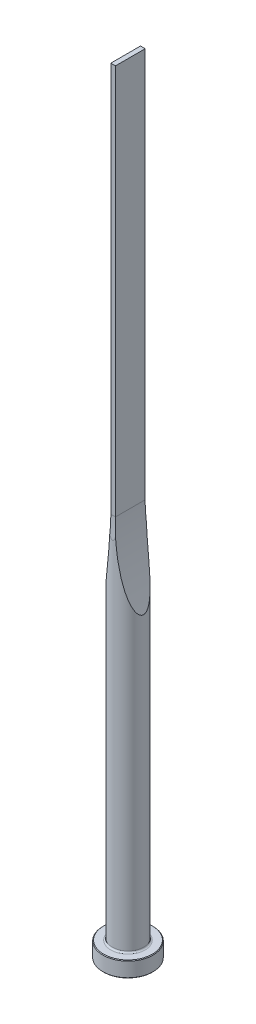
ISO-10303-21;
HEADER;
FILE_DESCRIPTION(('STEP AP214'),'2;1');
FILE_NAME('part.step','',(''),(''),'','','');
FILE_SCHEMA(('AUTOMOTIVE_DESIGN { 1 0 10303 214 1 1 1 1 }'));
ENDSEC;
DATA;
#1=APPLICATION_CONTEXT('core data for automotive mechanical design processes');
#2=APPLICATION_PROTOCOL_DEFINITION('international standard','automotive_design',2000,#1);
#3=PRODUCT_CONTEXT('',#1,'mechanical');
#4=PRODUCT('Part','Part','',(#3));
#5=PRODUCT_RELATED_PRODUCT_CATEGORY('part','',(#4));
#6=PRODUCT_DEFINITION_FORMATION('','',#4);
#7=PRODUCT_DEFINITION_CONTEXT('part definition',#1,'design');
#8=PRODUCT_DEFINITION('design','',#6,#7);
#9=PRODUCT_DEFINITION_SHAPE('','',#8);
#10=(LENGTH_UNIT() NAMED_UNIT(*) SI_UNIT(.MILLI.,.METRE.));
#11=(NAMED_UNIT(*) PLANE_ANGLE_UNIT() SI_UNIT($,.RADIAN.));
#12=(NAMED_UNIT(*) SI_UNIT($,.STERADIAN.) SOLID_ANGLE_UNIT());
#13=UNCERTAINTY_MEASURE_WITH_UNIT(LENGTH_MEASURE(1.E-05),#10,'distance_accuracy_value','');
#14=(GEOMETRIC_REPRESENTATION_CONTEXT(3) GLOBAL_UNCERTAINTY_ASSIGNED_CONTEXT((#13)) GLOBAL_UNIT_ASSIGNED_CONTEXT((#10,
#11,#12)) REPRESENTATION_CONTEXT('',''));
#15=CARTESIAN_POINT('',(0.,0.,0.));
#16=DIRECTION('',(0.,0.,1.));
#17=DIRECTION('',(1.,0.,0.));
#18=AXIS2_PLACEMENT_3D('',#15,#16,#17);
#19=CARTESIAN_POINT('',(0.,0.,0.));
#20=DIRECTION('',(0.,1.,0.));
#21=DIRECTION('',(-1.,0.,0.));
#22=AXIS2_PLACEMENT_3D('',#19,#20,#21);
#23=PLANE('',#22);
#24=CARTESIAN_POINT('',(0.,0.,0.));
#25=DIRECTION('',(0.,1.,0.));
#26=DIRECTION('',(-1.,0.,0.));
#27=AXIS2_PLACEMENT_3D('',#24,#25,#26);
#28=CIRCLE('',#27,7.8);
#29=CARTESIAN_POINT('',(-7.8,0.,0.));
#30=VERTEX_POINT('',#29);
#31=EDGE_CURVE('E133',#30,#30,#28,.T.);
#32=ORIENTED_EDGE('',*,*,#31,.F.);
#33=EDGE_LOOP('',(#32));
#34=FACE_BOUND('',#33,.T.);
#35=ADVANCED_FACE('F32',(#34),#23,.F.);
#36=CARTESIAN_POINT('',(0.,0.,0.));
#37=DIRECTION('',(0.,1.,0.));
#38=DIRECTION('',(-1.,0.,0.));
#39=AXIS2_PLACEMENT_3D('',#36,#37,#38);
#40=CONICAL_SURFACE('',#39,7.8,0.785398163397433);
#41=CARTESIAN_POINT('',(0.,0.200000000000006,0.));
#42=DIRECTION('',(0.,1.,0.));
#43=DIRECTION('',(-1.,0.,0.));
#44=AXIS2_PLACEMENT_3D('',#41,#42,#43);
#45=CIRCLE('',#44,8.);
#46=CARTESIAN_POINT('',(-8.,0.200000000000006,0.));
#47=VERTEX_POINT('',#46);
#48=EDGE_CURVE('E130',#47,#47,#45,.T.);
#49=ORIENTED_EDGE('',*,*,#48,.F.);
#50=EDGE_LOOP('',(#49));
#51=FACE_BOUND('',#50,.T.);
#52=ORIENTED_EDGE('',*,*,#31,.T.);
#53=EDGE_LOOP('',(#52));
#54=FACE_BOUND('',#53,.T.);
#55=ADVANCED_FACE('F171',(#51,#54),#40,.T.);
#56=CARTESIAN_POINT('',(0.,250.,0.));
#57=DIRECTION('',(0.,1.,0.));
#58=DIRECTION('',(-1.,0.,0.));
#59=AXIS2_PLACEMENT_3D('',#56,#57,#58);
#60=CYLINDRICAL_SURFACE('',#59,8.);
#61=CARTESIAN_POINT('',(0.,4.8,0.));
#62=DIRECTION('',(0.,1.,0.));
#63=DIRECTION('',(-1.,0.,0.));
#64=AXIS2_PLACEMENT_3D('',#61,#62,#63);
#65=CIRCLE('',#64,8.);
#66=CARTESIAN_POINT('',(-8.,4.8,0.));
#67=VERTEX_POINT('',#66);
#68=EDGE_CURVE('E127',#67,#67,#65,.T.);
#69=ORIENTED_EDGE('',*,*,#68,.F.);
#70=EDGE_LOOP('',(#69));
#71=FACE_BOUND('',#70,.T.);
#72=ORIENTED_EDGE('',*,*,#48,.T.);
#73=EDGE_LOOP('',(#72));
#74=FACE_BOUND('',#73,.T.);
#75=ADVANCED_FACE('F176',(#71,#74),#60,.T.);
#76=CARTESIAN_POINT('',(0.,4.8,0.));
#77=DIRECTION('',(0.,-1.,0.));
#78=DIRECTION('',(1.,0.,0.));
#79=AXIS2_PLACEMENT_3D('',#76,#77,#78);
#80=CONICAL_SURFACE('',#79,8.,0.785398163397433);
#81=CARTESIAN_POINT('',(0.,5.,0.));
#82=DIRECTION('',(0.,1.,0.));
#83=DIRECTION('',(-1.,0.,0.));
#84=AXIS2_PLACEMENT_3D('',#81,#82,#83);
#85=CIRCLE('',#84,7.8);
#86=CARTESIAN_POINT('',(-7.8,5.,0.));
#87=VERTEX_POINT('',#86);
#88=EDGE_CURVE('E124',#87,#87,#85,.T.);
#89=ORIENTED_EDGE('',*,*,#88,.F.);
#90=EDGE_LOOP('',(#89));
#91=FACE_BOUND('',#90,.T.);
#92=ORIENTED_EDGE('',*,*,#68,.T.);
#93=EDGE_LOOP('',(#92));
#94=FACE_BOUND('',#93,.T.);
#95=ADVANCED_FACE('F183',(#91,#94),#80,.T.);
#96=CARTESIAN_POINT('',(7.8,5.,0.));
#97=DIRECTION('',(0.,-1.,0.));
#98=DIRECTION('',(1.,0.,0.));
#99=AXIS2_PLACEMENT_3D('',#96,#97,#98);
#100=PLANE('',#99);
#101=CARTESIAN_POINT('',(0.,5.,0.));
#102=DIRECTION('',(0.,1.,0.));
#103=DIRECTION('',(-1.,0.,0.));
#104=AXIS2_PLACEMENT_3D('',#101,#102,#103);
#105=CIRCLE('',#104,5.50000000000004);
#106=CARTESIAN_POINT('',(-5.50000000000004,5.,0.));
#107=VERTEX_POINT('',#106);
#108=EDGE_CURVE('E121',#107,#107,#105,.T.);
#109=ORIENTED_EDGE('',*,*,#108,.F.);
#110=EDGE_LOOP('',(#109));
#111=FACE_BOUND('',#110,.T.);
#112=ORIENTED_EDGE('',*,*,#88,.T.);
#113=EDGE_LOOP('',(#112));
#114=FACE_BOUND('',#113,.T.);
#115=ADVANCED_FACE('F190',(#111,#114),#100,.F.);
#116=CARTESIAN_POINT('',(0.,5.5,0.));
#117=DIRECTION('',(0.,1.,0.));
#118=DIRECTION('',(-1.,0.,0.));
#119=AXIS2_PLACEMENT_3D('',#116,#117,#118);
#120=TOROIDAL_SURFACE('',#119,5.50000000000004,0.5);
#121=CARTESIAN_POINT('',(0.,5.50000000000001,0.));
#122=DIRECTION('',(0.,1.,0.));
#123=DIRECTION('',(-1.,0.,0.));
#124=AXIS2_PLACEMENT_3D('',#121,#122,#123);
#125=CIRCLE('',#124,5.00000000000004);
#126=CARTESIAN_POINT('',(-5.00000000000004,5.50000000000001,0.));
#127=VERTEX_POINT('',#126);
#128=EDGE_CURVE('E112',#127,#127,#125,.T.);
#129=ORIENTED_EDGE('',*,*,#128,.F.);
#130=EDGE_LOOP('',(#129));
#131=FACE_BOUND('',#130,.T.);
#132=ORIENTED_EDGE('',*,*,#108,.T.);
#133=EDGE_LOOP('',(#132));
#134=FACE_BOUND('',#133,.T.);
#135=ADVANCED_FACE('F168',(#131,#134),#120,.F.);
#136=CARTESIAN_POINT('',(0.,250.,0.));
#137=DIRECTION('',(0.,1.,0.));
#138=DIRECTION('',(-1.,0.,0.));
#139=AXIS2_PLACEMENT_3D('',#136,#137,#138);
#140=CYLINDRICAL_SURFACE('',#139,5.00000000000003);
#141=CARTESIAN_POINT('',(5.00000000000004,97.6698426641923,0.));
#142=CARTESIAN_POINT('',(4.99999699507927,97.6698517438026,0.0982088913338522));
#143=CARTESIAN_POINT('',(4.99706880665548,97.6790343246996,0.196449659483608));
#144=CARTESIAN_POINT('',(4.98575197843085,97.7145811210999,0.389459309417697));
#145=CARTESIAN_POINT('',(4.97735516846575,97.7409710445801,0.484222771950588));
#146=CARTESIAN_POINT('',(4.95365028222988,97.8156623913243,0.68862473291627));
#147=CARTESIAN_POINT('',(4.9372096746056,97.867566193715,0.796789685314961));
#148=CARTESIAN_POINT('',(4.89948999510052,97.9871540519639,1.00302693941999));
#149=CARTESIAN_POINT('',(4.87820124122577,98.0548696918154,1.1010784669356));
#150=CARTESIAN_POINT('',(4.8359382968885,98.1899604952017,1.27288902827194));
#151=CARTESIAN_POINT('',(4.81543376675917,98.2557387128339,1.34805086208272));
#152=CARTESIAN_POINT('',(4.77273910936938,98.3933128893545,1.49218520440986));
#153=CARTESIAN_POINT('',(4.75054772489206,98.4651133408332,1.56115301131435));
#154=CARTESIAN_POINT('',(4.70492872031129,98.6134173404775,1.69368419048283));
#155=CARTESIAN_POINT('',(4.68149855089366,98.6899306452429,1.75723565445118));
#156=CARTESIAN_POINT('',(4.63379920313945,98.8464790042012,1.87941496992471));
#157=CARTESIAN_POINT('',(4.60953025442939,98.9265130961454,1.93804415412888));
#158=CARTESIAN_POINT('',(4.55107793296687,99.1202862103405,2.07241841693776));
#159=CARTESIAN_POINT('',(4.51662674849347,99.2352913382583,2.1462168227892));
#160=CARTESIAN_POINT('',(4.44705609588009,99.4692969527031,2.28688478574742));
#161=CARTESIAN_POINT('',(4.4119363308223,99.5882992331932,2.35375117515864));
#162=CARTESIAN_POINT('',(4.34130054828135,99.8295316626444,2.48162307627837));
#163=CARTESIAN_POINT('',(4.30578400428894,99.9517664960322,2.54261941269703));
#164=CARTESIAN_POINT('',(4.23462595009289,100.198657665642,2.65943766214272));
#165=CARTESIAN_POINT('',(4.19898441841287,100.323314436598,2.71525863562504));
#166=CARTESIAN_POINT('',(4.09180404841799,100.701321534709,2.87644213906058));
#167=CARTESIAN_POINT('',(4.02032821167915,100.957621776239,2.97496635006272));
#168=CARTESIAN_POINT('',(3.91395519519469,101.345838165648,3.1119527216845));
#169=CARTESIAN_POINT('',(3.87865329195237,101.47581215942,3.15579760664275));
#170=CARTESIAN_POINT('',(3.80837436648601,101.736896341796,3.24026413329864));
#171=CARTESIAN_POINT('',(3.77339734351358,101.868006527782,3.28088578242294));
#172=CARTESIAN_POINT('',(3.67901594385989,102.225055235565,3.38716791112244));
#173=CARTESIAN_POINT('',(3.61998329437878,102.451927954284,3.45002099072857));
#174=CARTESIAN_POINT('',(3.50325291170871,102.90790796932,3.56849067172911));
#175=CARTESIAN_POINT('',(3.44555534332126,103.137015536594,3.62410638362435));
#176=CARTESIAN_POINT('',(3.33162157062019,103.597119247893,3.7291155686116));
#177=CARTESIAN_POINT('',(3.27538602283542,103.828116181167,3.77850628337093));
#178=CARTESIAN_POINT('',(3.16450650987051,104.291592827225,3.87183907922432));
#179=CARTESIAN_POINT('',(3.10986263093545,104.524072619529,3.91578086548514));
#180=CARTESIAN_POINT('',(2.94823548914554,105.224261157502,4.04061145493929));
#181=CARTESIAN_POINT('',(2.84377434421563,105.693840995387,4.11431091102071));
#182=CARTESIAN_POINT('',(2.64200093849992,106.636639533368,4.24668601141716));
#183=CARTESIAN_POINT('',(2.54468945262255,107.109858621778,4.30536002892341));
#184=CARTESIAN_POINT('',(2.40413804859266,107.822469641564,4.38440453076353));
#185=CARTESIAN_POINT('',(2.35812547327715,108.0608289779,4.40928874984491));
#186=CARTESIAN_POINT('',(2.26798702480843,108.538154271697,4.45632364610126));
#187=CARTESIAN_POINT('',(2.22386100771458,108.777120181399,4.47847453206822));
#188=CARTESIAN_POINT('',(2.09433007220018,109.494884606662,4.54125653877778));
#189=CARTESIAN_POINT('',(2.01177741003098,109.974523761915,4.57821418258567));
#190=CARTESIAN_POINT('',(1.85448213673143,110.93502672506,4.64415195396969));
#191=CARTESIAN_POINT('',(1.77973040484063,111.415888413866,4.67314146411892));
#192=CARTESIAN_POINT('',(1.63799243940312,112.379101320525,4.72468650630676));
#193=CARTESIAN_POINT('',(1.57100633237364,112.861452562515,4.74724193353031));
#194=CARTESIAN_POINT('',(1.42973388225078,113.943119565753,4.79193069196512));
#195=CARTESIAN_POINT('',(1.35754438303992,114.542767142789,4.81266782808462));
#196=CARTESIAN_POINT('',(1.22523387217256,115.743588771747,4.84803900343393));
#197=CARTESIAN_POINT('',(1.165113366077,116.344762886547,4.8626727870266));
#198=CARTESIAN_POINT('',(1.05697486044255,117.548395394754,4.88731818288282));
#199=CARTESIAN_POINT('',(1.00895895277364,118.150853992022,4.89732899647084));
#200=CARTESIAN_POINT('',(0.925070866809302,119.356654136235,4.91386505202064));
#201=CARTESIAN_POINT('',(0.889198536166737,119.959995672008,4.92039033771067));
#202=CARTESIAN_POINT('',(0.829566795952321,121.168270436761,4.93079465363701));
#203=CARTESIAN_POINT('',(0.805826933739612,121.773204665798,4.93466941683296));
#204=CARTESIAN_POINT('',(0.770558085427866,122.98344027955,4.94029945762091));
#205=CARTESIAN_POINT('',(0.75902913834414,123.588741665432,4.94205472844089));
#206=CARTESIAN_POINT('',(0.748188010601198,124.799389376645,4.94370758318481));
#207=CARTESIAN_POINT('',(0.748874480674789,125.404735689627,4.9436053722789));
#208=CARTESIAN_POINT('',(0.7624605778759,126.615287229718,4.94152823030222));
#209=CARTESIAN_POINT('',(0.775360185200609,127.220492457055,4.93955330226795));
#210=CARTESIAN_POINT('',(0.81332365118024,128.429137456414,4.93344440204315));
#211=CARTESIAN_POINT('',(0.838359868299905,129.032578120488,4.92931533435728));
#212=CARTESIAN_POINT('',(0.900572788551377,130.238811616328,4.9183297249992));
#213=CARTESIAN_POINT('',(0.937749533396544,130.841604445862,4.91147317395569));
#214=CARTESIAN_POINT('',(1.02423462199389,132.04640806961,4.89416898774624));
#215=CARTESIAN_POINT('',(1.07354573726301,132.648418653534,4.8837205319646));
#216=CARTESIAN_POINT('',(1.18426659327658,133.851222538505,4.85805977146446));
#217=CARTESIAN_POINT('',(1.24567622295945,134.452015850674,4.84284751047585));
#218=CARTESIAN_POINT('',(1.38041540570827,135.650842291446,4.80617538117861));
#219=CARTESIAN_POINT('',(1.45372050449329,136.248878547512,4.7847282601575));
#220=CARTESIAN_POINT('',(1.6122791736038,137.443051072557,4.73365637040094));
#221=CARTESIAN_POINT('',(1.69753323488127,138.039187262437,4.70403126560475));
#222=CARTESIAN_POINT('',(1.8798455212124,139.228758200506,4.63418918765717));
#223=CARTESIAN_POINT('',(1.97689829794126,139.822194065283,4.5939770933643));
#224=CARTESIAN_POINT('',(2.18267352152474,141.005918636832,4.49986490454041));
#225=CARTESIAN_POINT('',(2.29139448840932,141.596207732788,4.44596654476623));
#226=CARTESIAN_POINT('',(2.45986315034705,142.462299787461,4.35348615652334));
#227=CARTESIAN_POINT('',(2.51518571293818,142.739713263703,4.32182626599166));
#228=CARTESIAN_POINT('',(2.62833111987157,143.293477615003,4.25396725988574));
#229=CARTESIAN_POINT('',(2.68615395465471,143.569828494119,4.21776816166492));
#230=CARTESIAN_POINT('',(2.80427875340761,144.121446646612,4.14017109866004));
#231=CARTESIAN_POINT('',(2.86458217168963,144.396713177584,4.09877005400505));
#232=CARTESIAN_POINT('',(2.98755952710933,144.945755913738,4.0100176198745));
#233=CARTESIAN_POINT('',(3.05023343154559,145.219532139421,3.9626663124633));
#234=CARTESIAN_POINT('',(3.17767517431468,145.764537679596,3.86121727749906));
#235=CARTESIAN_POINT('',(3.24243683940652,146.035771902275,3.80713829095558));
#236=CARTESIAN_POINT('',(3.37406891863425,146.576003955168,3.6909849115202));
#237=CARTESIAN_POINT('',(3.44093920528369,146.845001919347,3.62891100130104));
#238=CARTESIAN_POINT('',(3.57652106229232,147.379915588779,3.49536098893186));
#239=CARTESIAN_POINT('',(3.64523082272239,147.645833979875,3.423893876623));
#240=CARTESIAN_POINT('',(3.78423448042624,148.173910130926,3.26961382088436));
#241=CARTESIAN_POINT('',(3.85452797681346,148.436068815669,3.18680372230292));
#242=CARTESIAN_POINT('',(3.98084744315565,148.898924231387,3.02669103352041));
#243=CARTESIAN_POINT('',(4.03665872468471,149.100611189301,2.95209405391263));
#244=CARTESIAN_POINT('',(4.1486336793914,149.499925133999,2.79255461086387));
#245=CARTESIAN_POINT('',(4.20479751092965,149.697550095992,2.70760712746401));
#246=CARTESIAN_POINT('',(4.31689598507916,150.087040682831,2.52505376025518));
#247=CARTESIAN_POINT('',(4.37283057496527,150.278905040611,2.42744511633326));
#248=CARTESIAN_POINT('',(4.48350393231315,150.654038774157,2.2164044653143));
#249=CARTESIAN_POINT('',(4.53824401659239,150.837317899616,2.10299101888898));
#250=CARTESIAN_POINT('',(4.61847515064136,151.103049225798,1.91683821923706));
#251=CARTESIAN_POINT('',(4.64503859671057,151.1905248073,1.85173475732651));
#252=CARTESIAN_POINT('',(4.69706434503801,151.360959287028,1.71549282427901));
#253=CARTESIAN_POINT('',(4.72252723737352,151.443920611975,1.64435764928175));
#254=CARTESIAN_POINT('',(4.77174387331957,151.603503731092,1.49551754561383));
#255=CARTESIAN_POINT('',(4.79550570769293,151.680155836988,1.41784815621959));
#256=CARTESIAN_POINT('',(4.84072891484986,151.825415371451,1.25478768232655));
#257=CARTESIAN_POINT('',(4.86219348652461,151.894033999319,1.16940764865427));
#258=CARTESIAN_POINT('',(4.89983178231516,152.013925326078,0.999221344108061));
#259=CARTESIAN_POINT('',(4.91632155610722,152.066252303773,0.915239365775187));
#260=CARTESIAN_POINT('',(4.94568332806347,152.159190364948,0.740314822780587));
#261=CARTESIAN_POINT('',(4.95855605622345,152.199803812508,0.649373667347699));
#262=CARTESIAN_POINT('',(4.97967235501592,152.266318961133,0.460408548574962));
#263=CARTESIAN_POINT('',(4.98786140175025,152.292047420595,0.36231558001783));
#264=CARTESIAN_POINT('',(4.99834260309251,152.324962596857,0.162784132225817));
#265=CARTESIAN_POINT('',(5.00064333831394,152.332176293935,0.0613507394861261));
#266=CARTESIAN_POINT('',(4.99912871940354,152.327423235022,-0.129738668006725));
#267=CARTESIAN_POINT('',(4.99596097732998,152.317487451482,-0.219457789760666));
#268=CARTESIAN_POINT('',(4.98509069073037,152.283340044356,-0.395853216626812));
#269=CARTESIAN_POINT('',(4.97738412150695,152.259115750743,-0.482526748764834));
#270=CARTESIAN_POINT('',(4.95515693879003,152.189090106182,-0.677358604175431));
#271=CARTESIAN_POINT('',(4.9392594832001,152.138911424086,-0.783765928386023));
#272=CARTESIAN_POINT('',(4.9027276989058,152.023129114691,-0.986908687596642));
#273=CARTESIAN_POINT('',(4.88208302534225,151.957491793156,-1.08362232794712));
#274=CARTESIAN_POINT('',(4.84100760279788,151.826274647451,-1.25341133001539));
#275=CARTESIAN_POINT('',(4.82103631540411,151.762251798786,-1.32783051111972));
#276=CARTESIAN_POINT('',(4.77941264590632,151.628237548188,-1.47062973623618));
#277=CARTESIAN_POINT('',(4.75775900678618,151.558241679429,-1.53900518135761));
#278=CARTESIAN_POINT('',(4.71321084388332,151.413569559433,-1.67046986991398));
#279=CARTESIAN_POINT('',(4.6903136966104,151.33888335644,-1.73354716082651));
#280=CARTESIAN_POINT('',(4.64367110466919,151.18599846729,-1.85486860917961));
#281=CARTESIAN_POINT('',(4.61992588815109,151.107800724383,-1.9131140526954));
#282=CARTESIAN_POINT('',(4.56303275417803,150.919482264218,-2.04589785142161));
#283=CARTESIAN_POINT('',(4.52962317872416,150.808149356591,-2.11860066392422));
#284=CARTESIAN_POINT('',(4.46212127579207,150.58155553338,-2.25730286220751));
#285=CARTESIAN_POINT('',(4.42802864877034,150.466292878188,-2.32329922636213));
#286=CARTESIAN_POINT('',(4.35942592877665,150.232589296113,-2.44960786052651));
#287=CARTESIAN_POINT('',(4.32491528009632,150.11414380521,-2.50991133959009));
#288=CARTESIAN_POINT('',(4.25574061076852,149.874859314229,-2.62548976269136));
#289=CARTESIAN_POINT('',(4.22107656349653,149.754019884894,-2.68076379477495));
#290=CARTESIAN_POINT('',(4.11679730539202,149.387553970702,-2.84047005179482));
#291=CARTESIAN_POINT('',(4.04719699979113,149.139007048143,-2.93824759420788));
#292=CARTESIAN_POINT('',(3.94352939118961,148.762442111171,-3.07437538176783));
#293=CARTESIAN_POINT('',(3.90911066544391,148.636352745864,-3.11797799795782));
#294=CARTESIAN_POINT('',(3.84056213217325,148.383045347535,-3.20203557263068));
#295=CARTESIAN_POINT('',(3.80643232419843,148.255827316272,-3.24249053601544));
#296=CARTESIAN_POINT('',(3.71467888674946,147.910771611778,-3.34797324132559));
#297=CARTESIAN_POINT('',(3.65738498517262,147.692023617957,-3.41031063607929));
#298=CARTESIAN_POINT('',(3.54400618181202,147.252330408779,-3.5279863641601));
#299=CARTESIAN_POINT('',(3.48792142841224,147.031384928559,-3.58332384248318));
#300=CARTESIAN_POINT('',(3.37708493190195,146.587636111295,-3.68796817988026));
#301=CARTESIAN_POINT('',(3.3223337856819,146.364832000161,-3.73727237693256));
#302=CARTESIAN_POINT('',(3.21429209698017,145.91776155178,-3.83058875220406));
#303=CARTESIAN_POINT('',(3.16100163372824,145.693495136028,-3.87460064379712));
#304=CARTESIAN_POINT('',(3.00324290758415,145.018008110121,-3.99983204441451));
#305=CARTESIAN_POINT('',(2.90109756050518,144.564940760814,-4.07405450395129));
#306=CARTESIAN_POINT('',(2.70342192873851,143.655210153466,-4.20781492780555));
#307=CARTESIAN_POINT('',(2.60789236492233,143.198546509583,-4.26735129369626));
#308=CARTESIAN_POINT('',(2.46960125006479,142.510743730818,-4.34786272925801));
#309=CARTESIAN_POINT('',(2.42426738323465,142.280625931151,-4.37326900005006));
#310=CARTESIAN_POINT('',(2.33535330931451,141.81978934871,-4.42138908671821));
#311=CARTESIAN_POINT('',(2.29177296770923,141.589070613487,-4.4441031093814));
#312=CARTESIAN_POINT('',(2.16367988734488,140.896056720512,-4.50861966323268));
#313=CARTESIAN_POINT('',(2.08182015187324,140.432929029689,-4.54679379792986));
#314=CARTESIAN_POINT('',(1.92537933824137,139.505437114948,-4.61521211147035));
#315=CARTESIAN_POINT('',(1.85078986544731,139.041074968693,-4.64546550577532));
#316=CARTESIAN_POINT('',(1.70884969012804,138.11087017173,-4.69953135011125));
#317=CARTESIAN_POINT('',(1.64149909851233,137.64502749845,-4.72334370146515));
#318=CARTESIAN_POINT('',(1.49589073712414,136.5788733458,-4.7717687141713));
#319=CARTESIAN_POINT('',(1.42001220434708,135.978158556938,-4.79466730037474));
#320=CARTESIAN_POINT('',(1.28037168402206,134.775088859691,-4.83382826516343));
#321=CARTESIAN_POINT('',(1.21661025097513,134.172733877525,-4.85009034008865));
#322=CARTESIAN_POINT('',(1.10124220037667,132.966636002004,-4.8775794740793));
#323=CARTESIAN_POINT('',(1.04963784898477,132.362892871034,-4.88880559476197));
#324=CARTESIAN_POINT('',(0.958630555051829,131.154440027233,-4.90746196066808));
#325=CARTESIAN_POINT('',(0.919227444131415,130.549730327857,-4.91489225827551));
#326=CARTESIAN_POINT('',(0.852590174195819,129.338669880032,-4.92688920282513));
#327=CARTESIAN_POINT('',(0.825375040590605,128.732318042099,-4.93145137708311));
#328=CARTESIAN_POINT('',(0.78321646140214,127.519173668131,-4.93832234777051));
#329=CARTESIAN_POINT('',(0.768273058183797,126.912381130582,-4.94063113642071));
#330=CARTESIAN_POINT('',(0.7506658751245,125.698683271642,-4.94333691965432));
#331=CARTESIAN_POINT('',(0.748000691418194,125.09177797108,-4.94373413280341));
#332=CARTESIAN_POINT('',(0.754947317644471,123.878040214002,-4.94267812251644));
#333=CARTESIAN_POINT('',(0.76455910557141,123.271207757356,-4.94122490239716));
#334=CARTESIAN_POINT('',(0.795991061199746,122.060344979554,-4.93625874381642));
#335=CARTESIAN_POINT('',(0.817761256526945,121.456313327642,-4.93275423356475));
#336=CARTESIAN_POINT('',(0.873464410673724,120.248828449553,-4.92319603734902));
#337=CARTESIAN_POINT('',(0.90739740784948,119.645375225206,-4.91714234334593));
#338=CARTESIAN_POINT('',(0.98741792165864,118.439187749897,-4.90170050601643));
#339=CARTESIAN_POINT('',(1.03350801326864,117.836453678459,-4.89231165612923));
#340=CARTESIAN_POINT('',(1.13781360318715,116.632123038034,-4.86911049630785));
#341=CARTESIAN_POINT('',(1.19602899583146,116.030526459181,-4.85529822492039));
#342=CARTESIAN_POINT('',(1.32443333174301,114.829852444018,-4.82185371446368));
#343=CARTESIAN_POINT('',(1.39460080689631,114.230772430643,-4.80223186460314));
#344=CARTESIAN_POINT('',(1.54692746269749,113.034404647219,-4.75535211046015));
#345=CARTESIAN_POINT('',(1.62908710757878,112.437116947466,-4.72809391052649));
#346=CARTESIAN_POINT('',(1.80526862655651,111.245088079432,-4.6636684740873));
#347=CARTESIAN_POINT('',(1.89928532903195,110.65034591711,-4.62650554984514));
#348=CARTESIAN_POINT('',(2.0990633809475,109.46380811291,-4.53936634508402));
#349=CARTESIAN_POINT('',(2.2048232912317,108.87201211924,-4.48939163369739));
#350=CARTESIAN_POINT('',(2.34532227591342,108.128801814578,-4.41593936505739));
#351=CARTESIAN_POINT('',(2.37470006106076,107.975585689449,-4.40022149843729));
#352=CARTESIAN_POINT('',(2.43422691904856,107.669433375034,-4.36757305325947));
#353=CARTESIAN_POINT('',(2.46437598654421,107.516497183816,-4.35064248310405));
#354=CARTESIAN_POINT('',(2.55597254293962,107.058132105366,-4.29790342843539));
#355=CARTESIAN_POINT('',(2.61856824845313,106.753152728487,-4.2601481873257));
#356=CARTESIAN_POINT('',(2.74669084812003,106.144919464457,-4.17869028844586));
#357=CARTESIAN_POINT('',(2.81221479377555,105.841664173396,-4.13499352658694));
#358=CARTESIAN_POINT('',(2.94615340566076,105.236891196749,-4.04065297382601));
#359=CARTESIAN_POINT('',(3.01456796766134,104.935373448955,-3.99000943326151));
#360=CARTESIAN_POINT('',(3.18170490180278,104.215906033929,-3.85903385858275));
#361=CARTESIAN_POINT('',(3.28173935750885,103.798933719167,-3.77487006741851));
#362=CARTESIAN_POINT('',(3.43548586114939,103.177504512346,-3.63349010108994));
#363=CARTESIAN_POINT('',(3.48739125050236,102.970877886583,-3.58379764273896));
#364=CARTESIAN_POINT('',(3.59230596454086,102.559379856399,-3.47863022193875));
#365=CARTESIAN_POINT('',(3.64531525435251,102.354508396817,-3.42315544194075));
#366=CARTESIAN_POINT('',(3.75469886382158,101.937778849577,-3.30289868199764));
#367=CARTESIAN_POINT('',(3.81111740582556,101.726020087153,-3.23781064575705));
#368=CARTESIAN_POINT('',(3.92476947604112,101.305554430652,-3.09906983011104));
#369=CARTESIAN_POINT('',(3.98200290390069,101.096847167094,-3.02541809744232));
#370=CARTESIAN_POINT('',(4.09681892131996,100.683914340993,-2.86802214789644));
#371=CARTESIAN_POINT('',(4.15440042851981,100.479679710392,-2.78430113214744));
#372=CARTESIAN_POINT('',(4.26949135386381,100.076809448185,-2.60439511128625));
#373=CARTESIAN_POINT('',(4.32700079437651,99.8781707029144,-2.5082172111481));
#374=CARTESIAN_POINT('',(4.43028324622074,99.5258260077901,-2.3198762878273));
#375=CARTESIAN_POINT('',(4.47621505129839,99.3707387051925,-2.2304064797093));
#376=CARTESIAN_POINT('',(4.56679022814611,99.067793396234,-2.03855775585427));
#377=CARTESIAN_POINT('',(4.61143110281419,98.9199490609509,-1.93615564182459));
#378=CARTESIAN_POINT('',(4.69845402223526,98.6342280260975,-1.71432946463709));
#379=CARTESIAN_POINT('',(4.74080961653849,98.4964633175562,-1.59474829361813));
#380=CARTESIAN_POINT('',(4.82032680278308,98.2397854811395,-1.33521257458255));
#381=CARTESIAN_POINT('',(4.85750638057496,98.120806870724,-1.19533221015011));
#382=CARTESIAN_POINT('',(4.90769951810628,97.9610821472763,-0.960061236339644));
#383=CARTESIAN_POINT('',(4.92405693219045,97.9092307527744,-0.87299342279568));
#384=CARTESIAN_POINT('',(4.95276787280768,97.818439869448,-0.691721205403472));
#385=CARTESIAN_POINT('',(4.96512753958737,97.7794805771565,-0.597528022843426));
#386=CARTESIAN_POINT('',(4.98299962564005,97.7232263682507,-0.419843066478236));
#387=CARTESIAN_POINT('',(4.98931861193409,97.7033752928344,-0.337252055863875));
#388=CARTESIAN_POINT('',(4.99781898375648,97.676683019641,-0.169781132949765));
#389=CARTESIAN_POINT('',(5.00000259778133,97.6698348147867,-0.0849024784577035));
#390=CARTESIAN_POINT('',(5.00000000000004,97.6698426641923,0.));
#391=B_SPLINE_CURVE_WITH_KNOTS('',3,(#141,#142,#143,#144,#145,#146,#147,#148,#149,#150,#151,
#152,#153,#154,#155,#156,#157,#158,#159,#160,#161,#162,#163,#164,#165,#166,#167,#168,#169,#170,
#171,#172,#173,#174,#175,#176,#177,#178,#179,#180,#181,#182,#183,#184,#185,#186,#187,#188,#189,
#190,#191,#192,#193,#194,#195,#196,#197,#198,#199,#200,#201,#202,#203,#204,#205,#206,#207,#208,
#209,#210,#211,#212,#213,#214,#215,#216,#217,#218,#219,#220,#221,#222,#223,#224,#225,#226,#227,
#228,#229,#230,#231,#232,#233,#234,#235,#236,#237,#238,#239,#240,#241,#242,#243,#244,#245,#246,
#247,#248,#249,#250,#251,#252,#253,#254,#255,#256,#257,#258,#259,#260,#261,#262,#263,#264,#265,
#266,#267,#268,#269,#270,#271,#272,#273,#274,#275,#276,#277,#278,#279,#280,#281,#282,#283,#284,
#285,#286,#287,#288,#289,#290,#291,#292,#293,#294,#295,#296,#297,#298,#299,#300,#301,#302,#303,
#304,#305,#306,#307,#308,#309,#310,#311,#312,#313,#314,#315,#316,#317,#318,#319,#320,#321,#322,
#323,#324,#325,#326,#327,#328,#329,#330,#331,#332,#333,#334,#335,#336,#337,#338,#339,#340,#341,
#342,#343,#344,#345,#346,#347,#348,#349,#350,#351,#352,#353,#354,#355,#356,#357,#358,#359,#360,
#361,#362,#363,#364,#365,#366,#367,#368,#369,#370,#371,#372,#373,#374,#375,#376,#377,#378,#379,
#380,#381,#382,#383,#384,#385,#386,#387,#388,#389,#390),.UNSPECIFIED.,.T.,.F.,(4,2,2,2,2,2,2,2,
2,2,2,2,2,2,2,2,2,2,2,2,2,2,2,2,2,2,2,2,2,2,2,2,2,2,2,2,2,2,2,2,2,2,2,2,2,2,2,2,2,2,2,2,2,2,2,2,
2,2,2,2,2,2,2,2,2,2,2,2,2,2,2,2,2,2,2,2,2,2,2,2,2,2,2,2,2,2,2,2,2,2,2,2,2,2,2,2,2,2,2,2,2,2,2,2,
2,2,2,2,2,2,2,2,2,2,2,2,2,2,2,2,2,2,2,2,4),(0.,0.294245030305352,0.588930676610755,
0.950164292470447,1.31212573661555,1.61758407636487,1.92327235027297,2.22961624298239,
2.53587692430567,2.95834524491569,3.38100577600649,3.80431657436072,4.22770407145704,
5.07825920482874,5.50315578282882,5.92805138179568,6.65601763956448,7.38407328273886,
8.11245040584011,8.84086692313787,10.3004734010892,11.7602378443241,12.4923132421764,
13.2243326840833,14.6884516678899,16.1508391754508,17.6132505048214,19.4260810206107,
21.2389874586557,23.0522069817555,24.8654037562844,26.6815127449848,28.4976275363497,
30.3135417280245,32.1294529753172,33.9412477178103,35.7530486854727,37.565263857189,
39.3774623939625,41.1859816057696,42.9945751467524,44.8023366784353,46.6098691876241,
47.4637565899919,48.3176407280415,49.1720328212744,50.0264131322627,50.8784645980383,
51.7304646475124,52.5816551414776,53.4326325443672,54.0989116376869,54.7655151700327,
55.4322642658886,56.0982368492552,56.4347350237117,56.7710504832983,57.1056422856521,
57.4397619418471,57.7399102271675,58.0399978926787,58.3435113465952,58.646582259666,
58.9161704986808,59.1859981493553,59.5401534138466,59.8950878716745,60.1952011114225,
60.4955407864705,60.7965407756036,61.0974603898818,61.5084756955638,61.9196753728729,
62.3314999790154,62.7433991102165,63.5707846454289,63.9841133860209,64.3974414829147,
65.100978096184,65.8046005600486,66.5085323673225,67.2125022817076,68.6231039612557,
70.0338591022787,70.7415778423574,71.4492421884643,72.8646483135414,74.2784002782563,
75.6921739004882,77.5097580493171,79.3274253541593,81.1454312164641,82.9634119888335,
84.784220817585,86.605035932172,88.4256428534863,90.2462465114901,92.0594217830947,
93.8726027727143,95.6861681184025,97.4997176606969,99.3100434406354,101.120439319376,
102.930048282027,104.739435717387,105.209821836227,105.680204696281,106.620988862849,
107.56084618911,108.500669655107,109.811133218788,110.467360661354,111.123567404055,
111.809237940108,112.494824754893,113.178861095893,113.862508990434,114.416600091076,
114.971699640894,115.532243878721,116.090788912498,116.397869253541,116.704475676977,
116.958990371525,117.213367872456),.UNSPECIFIED.);
#392=CARTESIAN_POINT('',(0.915475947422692,119.544884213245,-4.91547594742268));
#393=VERTEX_POINT('',#392);
#394=CARTESIAN_POINT('',(0.915475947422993,119.544884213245,4.91547594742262));
#395=VERTEX_POINT('',#394);
#396=EDGE_CURVE('E138',#393,#395,#391,.T.);
#397=ORIENTED_EDGE('',*,*,#396,.T.);
#398=CARTESIAN_POINT('',(-1.56124949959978,125.,4.74999999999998));
#399=CARTESIAN_POINT('',(-1.56124909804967,125.280275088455,4.74999999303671));
#400=CARTESIAN_POINT('',(-1.55728190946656,125.560549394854,4.7513095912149));
#401=CARTESIAN_POINT('',(-1.54122236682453,126.120839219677,4.75654354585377));
#402=CARTESIAN_POINT('',(-1.52913016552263,126.400854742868,4.76046785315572));
#403=CARTESIAN_POINT('',(-1.49622334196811,126.960158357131,4.77091379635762));
#404=CARTESIAN_POINT('',(-1.47541419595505,127.23944679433,4.77743380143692));
#405=CARTESIAN_POINT('',(-1.42390023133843,127.796993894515,4.79304036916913));
#406=CARTESIAN_POINT('',(-1.39319740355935,128.075252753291,4.80212641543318));
#407=CARTESIAN_POINT('',(-1.32163854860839,128.616514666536,4.82230425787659));
#408=CARTESIAN_POINT('',(-1.28135596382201,128.879595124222,4.83327546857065));
#409=CARTESIAN_POINT('',(-1.21025315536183,129.272594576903,4.85137807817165));
#410=CARTESIAN_POINT('',(-1.18472794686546,129.403511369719,4.85769686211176));
#411=CARTESIAN_POINT('',(-1.12941406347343,129.664393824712,4.87085630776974));
#412=CARTESIAN_POINT('',(-1.09962649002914,129.794359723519,4.87769683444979));
#413=CARTESIAN_POINT('',(-1.04028074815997,130.030993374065,4.89066177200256));
#414=CARTESIAN_POINT('',(-1.01154252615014,130.137869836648,4.89671054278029));
#415=CARTESIAN_POINT('',(-0.949556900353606,130.350283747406,4.90910859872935));
#416=CARTESIAN_POINT('',(-0.916310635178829,130.455821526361,4.91545780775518));
#417=CARTESIAN_POINT('',(-0.844084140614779,130.664473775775,4.92837326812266));
#418=CARTESIAN_POINT('',(-0.805125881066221,130.767595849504,4.9349386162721));
#419=CARTESIAN_POINT('',(-0.719242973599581,130.970408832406,4.94819344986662));
#420=CARTESIAN_POINT('',(-0.672333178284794,131.070105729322,4.95488268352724));
#421=CARTESIAN_POINT('',(-0.590193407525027,131.219314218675,4.96512953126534));
#422=CARTESIAN_POINT('',(-0.559251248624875,131.271162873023,4.96873759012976));
#423=CARTESIAN_POINT('',(-0.492379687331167,131.371634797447,4.97581229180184));
#424=CARTESIAN_POINT('',(-0.456453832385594,131.420260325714,4.97927903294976));
#425=CARTESIAN_POINT('',(-0.392115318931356,131.495011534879,4.98466324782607));
#426=CARTESIAN_POINT('',(-0.365747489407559,131.522870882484,4.98668429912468));
#427=CARTESIAN_POINT('',(-0.309588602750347,131.57497277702,4.99048569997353));
#428=CARTESIAN_POINT('',(-0.279803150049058,131.599221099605,4.99226643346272));
#429=CARTESIAN_POINT('',(-0.22666866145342,131.634995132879,4.9949051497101));
#430=CARTESIAN_POINT('',(-0.204394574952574,131.648089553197,4.99587455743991));
#431=CARTESIAN_POINT('',(-0.158090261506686,131.670718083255,4.99755352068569));
#432=CARTESIAN_POINT('',(-0.134063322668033,131.680258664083,4.99826354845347));
#433=CARTESIAN_POINT('',(-0.0886514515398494,131.693589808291,4.9992568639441));
#434=CARTESIAN_POINT('',(-0.0674708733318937,131.698062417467,4.99959071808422));
#435=CARTESIAN_POINT('',(-0.0246551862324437,131.703342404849,4.99998491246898));
#436=CARTESIAN_POINT('',(-0.00302040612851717,131.704152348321,5.00004544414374));
#437=CARTESIAN_POINT('',(0.0400515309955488,131.702017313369,4.99988599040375));
#438=CARTESIAN_POINT('',(0.0614887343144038,131.699073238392,4.99966607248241));
#439=CARTESIAN_POINT('',(0.103598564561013,131.689756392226,4.99897114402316));
#440=CARTESIAN_POINT('',(0.124270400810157,131.683380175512,4.99849587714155));
#441=CARTESIAN_POINT('',(0.172649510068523,131.664591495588,4.99709843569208));
#442=CARTESIAN_POINT('',(0.199804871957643,131.650779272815,4.99607315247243));
#443=CARTESIAN_POINT('',(0.251622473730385,131.619113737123,4.99373231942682));
#444=CARTESIAN_POINT('',(0.27627799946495,131.601249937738,4.99241601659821));
#445=CARTESIAN_POINT('',(0.342266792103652,131.547223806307,4.98845446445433));
#446=CARTESIAN_POINT('',(0.380989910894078,131.50793390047,4.9855944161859));
#447=CARTESIAN_POINT('',(0.452759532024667,131.424556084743,4.97958806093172));
#448=CARTESIAN_POINT('',(0.485787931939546,131.380453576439,4.97644088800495));
#449=CARTESIAN_POINT('',(0.565503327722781,131.26312163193,4.96816187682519));
#450=CARTESIAN_POINT('',(0.609051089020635,131.187790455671,4.9629342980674));
#451=CARTESIAN_POINT('',(0.689220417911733,131.033476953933,4.95243210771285));
#452=CARTESIAN_POINT('',(0.725825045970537,130.954486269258,4.94715741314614));
#453=CARTESIAN_POINT('',(0.794127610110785,130.793921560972,4.93665480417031));
#454=CARTESIAN_POINT('',(0.82579803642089,130.71233590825,4.93142729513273));
#455=CARTESIAN_POINT('',(0.885154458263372,130.547854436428,4.92111763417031));
#456=CARTESIAN_POINT('',(0.912845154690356,130.464960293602,4.91603531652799));
#457=CARTESIAN_POINT('',(0.991561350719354,130.213800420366,4.90099061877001));
#458=CARTESIAN_POINT('',(1.03784195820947,130.044035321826,4.89129471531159));
#459=CARTESIAN_POINT('',(1.12160376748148,129.702272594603,4.87276151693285));
#460=CARTESIAN_POINT('',(1.15907938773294,129.530273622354,4.86392476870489));
#461=CARTESIAN_POINT('',(1.22728467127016,129.184529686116,4.84716510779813));
#462=CARTESIAN_POINT('',(1.25799984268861,129.010781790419,4.83924417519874));
#463=CARTESIAN_POINT('',(1.31385289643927,128.662342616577,4.82437696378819));
#464=CARTESIAN_POINT('',(1.33899000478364,128.487651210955,4.81743082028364));
#465=CARTESIAN_POINT('',(1.40734156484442,127.962576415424,4.79809189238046));
#466=CARTESIAN_POINT('',(1.44349272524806,127.611211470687,4.78719953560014));
#467=CARTESIAN_POINT('',(1.50080391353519,126.907652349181,4.76953198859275));
#468=CARTESIAN_POINT('',(1.5219819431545,126.555459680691,4.76275185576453));
#469=CARTESIAN_POINT('',(1.55100340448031,125.854340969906,4.75337976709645));
#470=CARTESIAN_POINT('',(1.55899037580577,125.505421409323,4.7507427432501));
#471=CARTESIAN_POINT('',(1.56268162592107,124.807374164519,4.74952903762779));
#472=CARTESIAN_POINT('',(1.5583809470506,124.458246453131,4.75095399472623));
#473=CARTESIAN_POINT('',(1.5371897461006,123.761012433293,4.75785466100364));
#474=CARTESIAN_POINT('',(1.52032131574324,123.412905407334,4.76332326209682));
#475=CARTESIAN_POINT('',(1.47267594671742,122.717832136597,4.7782681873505));
#476=CARTESIAN_POINT('',(1.44190352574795,122.370865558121,4.78774320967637));
#477=CARTESIAN_POINT('',(1.36365394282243,121.678826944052,4.81063411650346));
#478=CARTESIAN_POINT('',(1.31617630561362,121.333754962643,4.8240501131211));
#479=CARTESIAN_POINT('',(1.22782468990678,120.819245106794,4.84699228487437));
#480=CARTESIAN_POINT('',(1.19552315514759,120.648278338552,4.85510823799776));
#481=CARTESIAN_POINT('',(1.12372438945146,120.307953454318,4.87222905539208));
#482=CARTESIAN_POINT('',(1.08422969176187,120.138594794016,4.88123360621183));
#483=CARTESIAN_POINT('',(0.99570217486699,119.802088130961,4.90006914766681));
#484=CARTESIAN_POINT('',(0.946657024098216,119.634943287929,4.90990119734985));
#485=CARTESIAN_POINT('',(0.862537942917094,119.387690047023,4.92512126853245));
#486=CARTESIAN_POINT('',(0.832712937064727,119.305788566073,4.93027740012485));
#487=CARTESIAN_POINT('',(0.768517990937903,119.143809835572,4.94069314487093));
#488=CARTESIAN_POINT('',(0.734150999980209,119.063731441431,4.94595268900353));
#489=CARTESIAN_POINT('',(0.659074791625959,118.905998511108,4.9565178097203));
#490=CARTESIAN_POINT('',(0.618328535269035,118.82836152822,4.96182347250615));
#491=CARTESIAN_POINT('',(0.528037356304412,118.678498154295,4.9722514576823));
#492=CARTESIAN_POINT('',(0.47854110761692,118.606244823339,4.97737461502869));
#493=CARTESIAN_POINT('',(0.401827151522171,118.516022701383,4.98386702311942));
#494=CARTESIAN_POINT('',(0.380686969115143,118.492964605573,4.98553608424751));
#495=CARTESIAN_POINT('',(0.336184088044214,118.448977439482,4.9887356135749));
#496=CARTESIAN_POINT('',(0.312817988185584,118.428051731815,4.99026586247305));
#497=CARTESIAN_POINT('',(0.263265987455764,118.389093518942,4.99312671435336));
#498=CARTESIAN_POINT('',(0.237049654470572,118.371098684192,4.99445470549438));
#499=CARTESIAN_POINT('',(0.181897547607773,118.339882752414,4.99676560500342));
#500=CARTESIAN_POINT('',(0.152971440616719,118.326645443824,4.99774968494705));
#501=CARTESIAN_POINT('',(0.102298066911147,118.309907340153,4.99899606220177));
#502=CARTESIAN_POINT('',(0.0811370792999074,118.304655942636,4.99938786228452));
#503=CARTESIAN_POINT('',(0.0382302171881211,118.297798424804,4.9998996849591));
#504=CARTESIAN_POINT('',(0.0164849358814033,118.296188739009,5.00001997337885));
#505=CARTESIAN_POINT('',(-0.0269727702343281,118.296797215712,4.99997452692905));
#506=CARTESIAN_POINT('',(-0.0486851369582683,118.299019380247,4.99980849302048));
#507=CARTESIAN_POINT('',(-0.0914351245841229,118.307043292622,4.99920977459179));
#508=CARTESIAN_POINT('',(-0.112472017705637,118.31284877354,4.99877681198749));
#509=CARTESIAN_POINT('',(-0.160507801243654,118.33001657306,4.9974991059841));
#510=CARTESIAN_POINT('',(-0.187061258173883,118.342604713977,4.99656385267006));
#511=CARTESIAN_POINT('',(-0.237848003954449,118.371778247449,4.99440467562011));
#512=CARTESIAN_POINT('',(-0.262075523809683,118.388373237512,4.99318005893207));
#513=CARTESIAN_POINT('',(-0.325987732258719,118.438060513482,4.98953016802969));
#514=CARTESIAN_POINT('',(-0.363355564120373,118.474076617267,4.98690191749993));
#515=CARTESIAN_POINT('',(-0.432792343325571,118.550821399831,4.98135512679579));
#516=CARTESIAN_POINT('',(-0.464844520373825,118.591564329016,4.97843571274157));
#517=CARTESIAN_POINT('',(-0.540982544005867,118.698328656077,4.97086484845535));
#518=CARTESIAN_POINT('',(-0.582371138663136,118.766244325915,4.966119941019));
#519=CARTESIAN_POINT('',(-0.658822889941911,118.90559326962,4.9565529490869));
#520=CARTESIAN_POINT('',(-0.693870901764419,118.977034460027,4.95173070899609));
#521=CARTESIAN_POINT('',(-0.759457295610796,119.12241662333,4.94209752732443));
#522=CARTESIAN_POINT('',(-0.789969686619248,119.19636922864,4.93728679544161));
#523=CARTESIAN_POINT('',(-0.847303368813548,119.345575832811,4.92776956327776));
#524=CARTESIAN_POINT('',(-0.874128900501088,119.420828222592,4.92306294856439));
#525=CARTESIAN_POINT('',(-0.949689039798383,119.646319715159,4.90924878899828));
#526=CARTESIAN_POINT('',(-0.994217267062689,119.797976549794,4.90033504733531));
#527=CARTESIAN_POINT('',(-1.07533721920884,120.103461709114,4.88316862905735));
#528=CARTESIAN_POINT('',(-1.11192387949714,120.257291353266,4.87491637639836));
#529=CARTESIAN_POINT('',(-1.1790212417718,120.566637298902,4.85912545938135));
#530=CARTESIAN_POINT('',(-1.20951893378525,120.722156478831,4.85158834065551));
#531=CARTESIAN_POINT('',(-1.26550324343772,121.034136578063,4.83728492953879));
#532=CARTESIAN_POINT('',(-1.29098915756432,121.190597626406,4.83051874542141));
#533=CARTESIAN_POINT('',(-1.36110123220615,121.66073098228,4.81142337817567));
#534=CARTESIAN_POINT('',(-1.39943115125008,121.975395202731,4.80028500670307));
#535=CARTESIAN_POINT('',(-1.46294686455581,122.605717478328,4.781301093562));
#536=CARTESIAN_POINT('',(-1.48814772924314,122.921373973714,4.77345177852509));
#537=CARTESIAN_POINT('',(-1.52589501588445,123.530876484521,4.76151277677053));
#538=CARTESIAN_POINT('',(-1.53921639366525,123.824670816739,4.75719469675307));
#539=CARTESIAN_POINT('',(-1.55689016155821,124.412310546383,4.7514394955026));
#540=CARTESIAN_POINT('',(-1.56124992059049,124.706155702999,4.75000000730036));
#541=CARTESIAN_POINT('',(-1.56124949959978,125.,4.74999999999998));
#542=B_SPLINE_CURVE_WITH_KNOTS('',3,(#398,#399,#400,#401,#402,#403,#404,#405,#406,#407,#408,
#409,#410,#411,#412,#413,#414,#415,#416,#417,#418,#419,#420,#421,#422,#423,#424,#425,#426,#427,
#428,#429,#430,#431,#432,#433,#434,#435,#436,#437,#438,#439,#440,#441,#442,#443,#444,#445,#446,
#447,#448,#449,#450,#451,#452,#453,#454,#455,#456,#457,#458,#459,#460,#461,#462,#463,#464,#465,
#466,#467,#468,#469,#470,#471,#472,#473,#474,#475,#476,#477,#478,#479,#480,#481,#482,#483,#484,
#485,#486,#487,#488,#489,#490,#491,#492,#493,#494,#495,#496,#497,#498,#499,#500,#501,#502,#503,
#504,#505,#506,#507,#508,#509,#510,#511,#512,#513,#514,#515,#516,#517,#518,#519,#520,#521,#522,
#523,#524,#525,#526,#527,#528,#529,#530,#531,#532,#533,#534,#535,#536,#537,#538,#539,#540,#541),
.UNSPECIFIED.,.T.,.F.,(4,2,2,2,2,2,2,2,2,2,2,2,2,2,2,2,2,2,2,2,2,2,2,2,2,2,2,2,2,2,2,2,2,2,2,2,
2,2,2,2,2,2,2,2,2,2,2,2,2,2,2,2,2,2,2,2,2,2,2,2,2,2,2,2,2,2,2,2,2,2,2,4),(0.,0.84079171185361,
1.68156761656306,2.5218161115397,3.36189563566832,4.16066974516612,4.5612110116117,
4.96164895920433,5.29408999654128,5.62644722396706,5.95755811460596,6.28805720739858,
6.46935117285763,6.65051674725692,6.76554794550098,6.88039313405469,6.95773039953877,
7.03492614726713,7.09958926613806,7.16420708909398,7.22880936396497,7.29347661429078,
7.38440430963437,7.47557008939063,7.64035473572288,7.80565391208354,8.06649360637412,
8.32796172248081,8.59083911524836,8.85340339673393,9.38168636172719,9.91030331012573,
10.4400426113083,10.9698553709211,12.029538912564,13.0879462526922,14.1347586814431,
15.1819935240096,16.227391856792,17.2724507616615,18.3175394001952,18.839959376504,
19.3621957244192,19.8851109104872,20.146967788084,20.4086554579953,20.6719230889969,
20.9337698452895,21.0276393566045,21.1216546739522,21.2167964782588,21.3116109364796,
21.3767537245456,21.4418327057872,21.5069796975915,21.5721946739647,21.659896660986,
21.7478108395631,21.9028287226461,22.0583267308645,22.2967439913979,22.5357234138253,
22.7760234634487,23.0160447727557,23.4906125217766,23.9654820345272,24.4413555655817,
24.9172958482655,25.8684364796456,26.8184829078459,27.7007063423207,28.5822040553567),.UNSPECIFIED.);
#543=CARTESIAN_POINT('',(-0.915475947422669,119.544884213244,4.91547594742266));
#544=VERTEX_POINT('',#543);
#545=EDGE_CURVE('E104',#395,#544,#542,.T.);
#546=ORIENTED_EDGE('',*,*,#545,.T.);
#547=CARTESIAN_POINT('',(-5.00000000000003,97.6698426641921,0.));
#548=CARTESIAN_POINT('',(-4.99999699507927,97.6698517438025,-0.0982088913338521));
#549=CARTESIAN_POINT('',(-4.99706880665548,97.6790343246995,-0.196449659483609));
#550=CARTESIAN_POINT('',(-4.98575197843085,97.7145811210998,-0.389459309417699));
#551=CARTESIAN_POINT('',(-4.97735516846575,97.74097104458,-0.484222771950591));
#552=CARTESIAN_POINT('',(-4.95365028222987,97.8156623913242,-0.68862473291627));
#553=CARTESIAN_POINT('',(-4.9372096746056,97.8675661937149,-0.796789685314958));
#554=CARTESIAN_POINT('',(-4.89948999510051,97.9871540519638,-1.00302693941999));
#555=CARTESIAN_POINT('',(-4.87820124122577,98.0548696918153,-1.10107846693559));
#556=CARTESIAN_POINT('',(-4.83593829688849,98.1899604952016,-1.27288902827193));
#557=CARTESIAN_POINT('',(-4.81543376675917,98.2557387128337,-1.3480508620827));
#558=CARTESIAN_POINT('',(-4.77273910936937,98.3933128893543,-1.49218520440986));
#559=CARTESIAN_POINT('',(-4.75054772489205,98.4651133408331,-1.56115301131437));
#560=CARTESIAN_POINT('',(-4.70492872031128,98.6134173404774,-1.69368419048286));
#561=CARTESIAN_POINT('',(-4.68149855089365,98.6899306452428,-1.75723565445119));
#562=CARTESIAN_POINT('',(-4.63379920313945,98.8464790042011,-1.8794149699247));
#563=CARTESIAN_POINT('',(-4.60953025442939,98.9265130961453,-1.93804415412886));
#564=CARTESIAN_POINT('',(-4.55107793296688,99.1202862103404,-2.07241841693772));
#565=CARTESIAN_POINT('',(-4.51662674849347,99.2352913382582,-2.14621682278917));
#566=CARTESIAN_POINT('',(-4.44705609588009,99.469296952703,-2.28688478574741));
#567=CARTESIAN_POINT('',(-4.4119363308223,99.5882992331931,-2.35375117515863));
#568=CARTESIAN_POINT('',(-4.34130054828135,99.8295316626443,-2.48162307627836));
#569=CARTESIAN_POINT('',(-4.30578400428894,99.9517664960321,-2.54261941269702));
#570=CARTESIAN_POINT('',(-4.23462595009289,100.198657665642,-2.65943766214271));
#571=CARTESIAN_POINT('',(-4.19898441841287,100.323314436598,-2.71525863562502));
#572=CARTESIAN_POINT('',(-4.091804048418,100.701321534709,-2.87644213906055));
#573=CARTESIAN_POINT('',(-4.02032821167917,100.957621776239,-2.97496635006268));
#574=CARTESIAN_POINT('',(-3.91395519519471,101.345838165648,-3.11195272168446));
#575=CARTESIAN_POINT('',(-3.87865329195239,101.47581215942,-3.15579760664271));
#576=CARTESIAN_POINT('',(-3.80837436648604,101.736896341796,-3.24026413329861));
#577=CARTESIAN_POINT('',(-3.77339734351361,101.868006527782,-3.28088578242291));
#578=CARTESIAN_POINT('',(-3.67901594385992,102.225055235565,-3.38716791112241));
#579=CARTESIAN_POINT('',(-3.6199832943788,102.451927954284,-3.45002099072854));
#580=CARTESIAN_POINT('',(-3.50325291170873,102.907907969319,-3.56849067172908));
#581=CARTESIAN_POINT('',(-3.44555534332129,103.137015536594,-3.62410638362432));
#582=CARTESIAN_POINT('',(-3.33162157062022,103.597119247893,-3.72911556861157));
#583=CARTESIAN_POINT('',(-3.27538602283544,103.828116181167,-3.77850628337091));
#584=CARTESIAN_POINT('',(-3.16450650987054,104.291592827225,-3.87183907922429));
#585=CARTESIAN_POINT('',(-3.10986263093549,104.524072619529,-3.9157808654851));
#586=CARTESIAN_POINT('',(-2.94823548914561,105.224261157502,-4.04061145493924));
#587=CARTESIAN_POINT('',(-2.8437743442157,105.693840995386,-4.11431091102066));
#588=CARTESIAN_POINT('',(-2.64200093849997,106.636639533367,-4.24668601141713));
#589=CARTESIAN_POINT('',(-2.54468945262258,107.109858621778,-4.30536002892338));
#590=CARTESIAN_POINT('',(-2.4041380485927,107.822469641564,-4.3844045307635));
#591=CARTESIAN_POINT('',(-2.3581254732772,108.060828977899,-4.40928874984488));
#592=CARTESIAN_POINT('',(-2.26798702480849,108.538154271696,-4.45632364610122));
#593=CARTESIAN_POINT('',(-2.22386100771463,108.777120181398,-4.47847453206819));
#594=CARTESIAN_POINT('',(-2.09433007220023,109.494884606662,-4.54125653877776));
#595=CARTESIAN_POINT('',(-2.01177741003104,109.974523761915,-4.57821418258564));
#596=CARTESIAN_POINT('',(-1.8544821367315,110.935026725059,-4.64415195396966));
#597=CARTESIAN_POINT('',(-1.77973040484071,111.415888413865,-4.67314146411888));
#598=CARTESIAN_POINT('',(-1.63799243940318,112.379101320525,-4.72468650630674));
#599=CARTESIAN_POINT('',(-1.57100633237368,112.861452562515,-4.74724193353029));
#600=CARTESIAN_POINT('',(-1.4297338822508,113.943119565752,-4.79193069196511));
#601=CARTESIAN_POINT('',(-1.35754438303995,114.542767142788,-4.81266782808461));
#602=CARTESIAN_POINT('',(-1.22523387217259,115.743588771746,-4.84803900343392));
#603=CARTESIAN_POINT('',(-1.16511336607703,116.344762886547,-4.86267278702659));
#604=CARTESIAN_POINT('',(-1.05697486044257,117.548395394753,-4.88731818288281));
#605=CARTESIAN_POINT('',(-1.00895895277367,118.150853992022,-4.89732899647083));
#606=CARTESIAN_POINT('',(-0.925070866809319,119.356654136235,-4.91386505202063));
#607=CARTESIAN_POINT('',(-0.889198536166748,119.959995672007,-4.92039033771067));
#608=CARTESIAN_POINT('',(-0.829566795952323,121.16827043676,-4.93079465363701));
#609=CARTESIAN_POINT('',(-0.805826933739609,121.773204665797,-4.93466941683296));
#610=CARTESIAN_POINT('',(-0.770558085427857,122.98344027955,-4.94029945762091));
#611=CARTESIAN_POINT('',(-0.75902913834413,123.588741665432,-4.94205472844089));
#612=CARTESIAN_POINT('',(-0.74818801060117,124.799389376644,-4.94370758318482));
#613=CARTESIAN_POINT('',(-0.748874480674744,125.404735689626,-4.9436053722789));
#614=CARTESIAN_POINT('',(-0.762460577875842,126.615287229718,-4.94152823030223));
#615=CARTESIAN_POINT('',(-0.775360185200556,127.220492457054,-4.93955330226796));
#616=CARTESIAN_POINT('',(-0.81332365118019,128.429137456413,-4.93344440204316));
#617=CARTESIAN_POINT('',(-0.838359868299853,129.032578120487,-4.92931533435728));
#618=CARTESIAN_POINT('',(-0.900572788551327,130.238811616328,-4.91832972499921));
#619=CARTESIAN_POINT('',(-0.937749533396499,130.841604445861,-4.91147317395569));
#620=CARTESIAN_POINT('',(-1.02423462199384,132.046408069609,-4.89416898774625));
#621=CARTESIAN_POINT('',(-1.07354573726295,132.648418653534,-4.88372053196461));
#622=CARTESIAN_POINT('',(-1.1842665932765,133.851222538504,-4.85805977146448));
#623=CARTESIAN_POINT('',(-1.24567622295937,134.452015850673,-4.84284751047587));
#624=CARTESIAN_POINT('',(-1.3804154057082,135.650842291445,-4.80617538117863));
#625=CARTESIAN_POINT('',(-1.45372050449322,136.248878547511,-4.78472826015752));
#626=CARTESIAN_POINT('',(-1.61227917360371,137.443051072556,-4.73365637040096));
#627=CARTESIAN_POINT('',(-1.69753323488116,138.039187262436,-4.70403126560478));
#628=CARTESIAN_POINT('',(-1.87984552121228,139.228758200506,-4.63418918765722));
#629=CARTESIAN_POINT('',(-1.97689829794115,139.822194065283,-4.59397709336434));
#630=CARTESIAN_POINT('',(-2.18267352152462,141.005918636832,-4.49986490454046));
#631=CARTESIAN_POINT('',(-2.29139448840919,141.596207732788,-4.4459665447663));
#632=CARTESIAN_POINT('',(-2.45986315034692,142.462299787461,-4.35348615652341));
#633=CARTESIAN_POINT('',(-2.51518571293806,142.739713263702,-4.32182626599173));
#634=CARTESIAN_POINT('',(-2.62833111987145,143.293477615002,-4.25396725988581));
#635=CARTESIAN_POINT('',(-2.68615395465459,143.569828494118,-4.21776816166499));
#636=CARTESIAN_POINT('',(-2.80427875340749,144.121446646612,-4.14017109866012));
#637=CARTESIAN_POINT('',(-2.8645821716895,144.396713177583,-4.09877005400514));
#638=CARTESIAN_POINT('',(-2.9875595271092,144.945755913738,-4.01001761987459));
#639=CARTESIAN_POINT('',(-3.05023343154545,145.21953213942,-3.9626663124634));
#640=CARTESIAN_POINT('',(-3.17767517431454,145.764537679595,-3.86121727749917));
#641=CARTESIAN_POINT('',(-3.24243683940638,146.035771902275,-3.80713829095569));
#642=CARTESIAN_POINT('',(-3.37406891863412,146.576003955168,-3.69098491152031));
#643=CARTESIAN_POINT('',(-3.44093920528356,146.845001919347,-3.62891100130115));
#644=CARTESIAN_POINT('',(-3.5765210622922,147.379915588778,-3.49536098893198));
#645=CARTESIAN_POINT('',(-3.64523082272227,147.645833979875,-3.42389387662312));
#646=CARTESIAN_POINT('',(-3.78423448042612,148.173910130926,-3.26961382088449));
#647=CARTESIAN_POINT('',(-3.85452797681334,148.436068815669,-3.18680372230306));
#648=CARTESIAN_POINT('',(-3.98084744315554,148.898924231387,-3.02669103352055));
#649=CARTESIAN_POINT('',(-4.03665872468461,149.1006111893,-2.95209405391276));
#650=CARTESIAN_POINT('',(-4.14863367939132,149.499925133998,-2.79255461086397));
#651=CARTESIAN_POINT('',(-4.20479751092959,149.697550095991,-2.70760712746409));
#652=CARTESIAN_POINT('',(-4.31689598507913,150.087040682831,-2.52505376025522));
#653=CARTESIAN_POINT('',(-4.37283057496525,150.278905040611,-2.42744511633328));
#654=CARTESIAN_POINT('',(-4.48350393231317,150.654038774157,-2.21640446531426));
#655=CARTESIAN_POINT('',(-4.53824401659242,150.837317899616,-2.1029910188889));
#656=CARTESIAN_POINT('',(-4.61847515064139,151.103049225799,-1.91683821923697));
#657=CARTESIAN_POINT('',(-4.6450385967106,151.1905248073,-1.85173475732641));
#658=CARTESIAN_POINT('',(-4.69706434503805,151.360959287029,-1.71549282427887));
#659=CARTESIAN_POINT('',(-4.72252723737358,151.443920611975,-1.64435764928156));
#660=CARTESIAN_POINT('',(-4.77174387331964,151.603503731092,-1.49551754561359));
#661=CARTESIAN_POINT('',(-4.795505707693,151.680155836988,-1.41784815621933));
#662=CARTESIAN_POINT('',(-4.84072891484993,151.825415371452,-1.25478768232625));
#663=CARTESIAN_POINT('',(-4.86219348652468,151.894033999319,-1.16940764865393));
#664=CARTESIAN_POINT('',(-4.89983178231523,152.013925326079,-0.99922134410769));
#665=CARTESIAN_POINT('',(-4.91632155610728,152.066252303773,-0.915239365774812));
#666=CARTESIAN_POINT('',(-4.94568332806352,152.159190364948,-0.74031482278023));
#667=CARTESIAN_POINT('',(-4.95855605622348,152.199803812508,-0.649373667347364));
#668=CARTESIAN_POINT('',(-4.97967235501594,152.266318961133,-0.460408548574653));
#669=CARTESIAN_POINT('',(-4.98786140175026,152.292047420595,-0.362315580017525));
#670=CARTESIAN_POINT('',(-4.99834260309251,152.324962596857,-0.162784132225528));
#671=CARTESIAN_POINT('',(-5.00064333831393,152.332176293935,-0.061350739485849));
#672=CARTESIAN_POINT('',(-4.99912871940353,152.327423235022,0.129738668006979));
#673=CARTESIAN_POINT('',(-4.99596097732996,152.317487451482,0.219457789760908));
#674=CARTESIAN_POINT('',(-4.98509069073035,152.283340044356,0.395853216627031));
#675=CARTESIAN_POINT('',(-4.97738412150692,152.259115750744,0.482526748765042));
#676=CARTESIAN_POINT('',(-4.95515693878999,152.189090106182,0.67735860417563));
#677=CARTESIAN_POINT('',(-4.93925948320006,152.138911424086,0.783765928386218));
#678=CARTESIAN_POINT('',(-4.90272769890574,152.023129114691,0.986908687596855));
#679=CARTESIAN_POINT('',(-4.88208302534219,151.957491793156,1.08362232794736));
#680=CARTESIAN_POINT('',(-4.8410076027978,151.82627464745,1.25341133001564));
#681=CARTESIAN_POINT('',(-4.82103631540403,151.762251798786,1.32783051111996));
#682=CARTESIAN_POINT('',(-4.77941264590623,151.628237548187,1.47062973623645));
#683=CARTESIAN_POINT('',(-4.75775900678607,151.558241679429,1.53900518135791));
#684=CARTESIAN_POINT('',(-4.7132108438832,151.413569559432,1.67046986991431));
#685=CARTESIAN_POINT('',(-4.69031369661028,151.33888335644,1.73354716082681));
#686=CARTESIAN_POINT('',(-4.64367110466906,151.18599846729,1.85486860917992));
#687=CARTESIAN_POINT('',(-4.61992588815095,151.107800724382,1.91311405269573));
#688=CARTESIAN_POINT('',(-4.56303275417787,150.919482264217,2.04589785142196));
#689=CARTESIAN_POINT('',(-4.52962317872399,150.80814935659,2.11860066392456));
#690=CARTESIAN_POINT('',(-4.46212127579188,150.581555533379,2.25730286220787));
#691=CARTESIAN_POINT('',(-4.42802864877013,150.466292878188,2.32329922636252));
#692=CARTESIAN_POINT('',(-4.35942592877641,150.232589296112,2.44960786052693));
#693=CARTESIAN_POINT('',(-4.32491528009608,150.114143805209,2.5099113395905));
#694=CARTESIAN_POINT('',(-4.25574061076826,149.874859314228,2.62548976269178));
#695=CARTESIAN_POINT('',(-4.22107656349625,149.754019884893,2.68076379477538));
#696=CARTESIAN_POINT('',(-4.11679730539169,149.387553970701,2.84047005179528));
#697=CARTESIAN_POINT('',(-4.04719699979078,149.139007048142,2.93824759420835));
#698=CARTESIAN_POINT('',(-3.94352939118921,148.76244211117,3.07437538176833));
#699=CARTESIAN_POINT('',(-3.9091106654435,148.636352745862,3.11797799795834));
#700=CARTESIAN_POINT('',(-3.84056213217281,148.383045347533,3.2020355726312));
#701=CARTESIAN_POINT('',(-3.80643232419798,148.25582731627,3.24249053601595));
#702=CARTESIAN_POINT('',(-3.714678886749,147.910771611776,3.34797324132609));
#703=CARTESIAN_POINT('',(-3.65738498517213,147.692023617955,3.4103106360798));
#704=CARTESIAN_POINT('',(-3.54400618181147,147.252330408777,3.52798636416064));
#705=CARTESIAN_POINT('',(-3.48792142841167,147.031384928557,3.58332384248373));
#706=CARTESIAN_POINT('',(-3.37708493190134,146.587636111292,3.68796817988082));
#707=CARTESIAN_POINT('',(-3.32233378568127,146.364832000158,3.73727237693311));
#708=CARTESIAN_POINT('',(-3.2142920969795,145.917761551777,3.83058875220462));
#709=CARTESIAN_POINT('',(-3.16100163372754,145.693495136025,3.87460064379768));
#710=CARTESIAN_POINT('',(-3.0032429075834,145.018008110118,3.99983204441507));
#711=CARTESIAN_POINT('',(-2.90109756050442,144.56494076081,4.07405450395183));
#712=CARTESIAN_POINT('',(-2.70342192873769,143.655210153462,4.20781492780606));
#713=CARTESIAN_POINT('',(-2.60789236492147,143.198546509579,4.26735129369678));
#714=CARTESIAN_POINT('',(-2.4696012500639,142.510743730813,4.34786272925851));
#715=CARTESIAN_POINT('',(-2.42426738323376,142.280625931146,4.37326900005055));
#716=CARTESIAN_POINT('',(-2.33535330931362,141.819789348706,4.42138908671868));
#717=CARTESIAN_POINT('',(-2.29177296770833,141.589070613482,4.44410310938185));
#718=CARTESIAN_POINT('',(-2.16367988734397,140.896056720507,4.50861966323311));
#719=CARTESIAN_POINT('',(-2.08182015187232,140.432929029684,4.54679379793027));
#720=CARTESIAN_POINT('',(-1.92537933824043,139.505437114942,4.61521211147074));
#721=CARTESIAN_POINT('',(-1.85078986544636,139.041074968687,4.6454655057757));
#722=CARTESIAN_POINT('',(-1.70884969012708,138.110870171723,4.6995313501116));
#723=CARTESIAN_POINT('',(-1.64149909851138,137.645027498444,4.72334370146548));
#724=CARTESIAN_POINT('',(-1.49589073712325,136.578873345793,4.77176871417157));
#725=CARTESIAN_POINT('',(-1.42001220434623,135.978158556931,4.79466730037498));
#726=CARTESIAN_POINT('',(-1.2803716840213,134.775088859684,4.83382826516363));
#727=CARTESIAN_POINT('',(-1.21661025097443,134.172733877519,4.85009034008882));
#728=CARTESIAN_POINT('',(-1.10124220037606,132.966636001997,4.87757947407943));
#729=CARTESIAN_POINT('',(-1.0496378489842,132.362892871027,4.88880559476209));
#730=CARTESIAN_POINT('',(-0.958630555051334,131.154440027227,4.90746196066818));
#731=CARTESIAN_POINT('',(-0.919227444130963,130.54973032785,4.9148922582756));
#732=CARTESIAN_POINT('',(-0.852590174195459,129.338669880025,4.92688920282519));
#733=CARTESIAN_POINT('',(-0.825375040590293,128.732318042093,4.93145137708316));
#734=CARTESIAN_POINT('',(-0.783216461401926,127.519173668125,4.93832234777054));
#735=CARTESIAN_POINT('',(-0.768273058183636,126.912381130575,4.94063113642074));
#736=CARTESIAN_POINT('',(-0.750665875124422,125.698683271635,4.94333691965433));
#737=CARTESIAN_POINT('',(-0.748000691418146,125.091777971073,4.94373413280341));
#738=CARTESIAN_POINT('',(-0.75494731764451,123.878040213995,4.94267812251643));
#739=CARTESIAN_POINT('',(-0.764559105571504,123.27120775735,4.94122490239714));
#740=CARTESIAN_POINT('',(-0.79599106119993,122.060344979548,4.93625874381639));
#741=CARTESIAN_POINT('',(-0.817761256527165,121.456313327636,4.93275423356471));
#742=CARTESIAN_POINT('',(-0.873464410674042,120.248828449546,4.92319603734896));
#743=CARTESIAN_POINT('',(-0.90739740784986,119.645375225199,4.91714234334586));
#744=CARTESIAN_POINT('',(-0.987417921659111,118.43918774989,4.90170050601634));
#745=CARTESIAN_POINT('',(-1.03350801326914,117.836453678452,4.89231165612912));
#746=CARTESIAN_POINT('',(-1.13781360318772,116.632123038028,4.86911049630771));
#747=CARTESIAN_POINT('',(-1.19602899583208,116.030526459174,4.85529822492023));
#748=CARTESIAN_POINT('',(-1.32443333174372,114.829852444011,4.82185371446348));
#749=CARTESIAN_POINT('',(-1.39460080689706,114.230772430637,4.80223186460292));
#750=CARTESIAN_POINT('',(-1.54692746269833,113.034404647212,4.75535211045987));
#751=CARTESIAN_POINT('',(-1.62908710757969,112.43711694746,4.72809391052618));
#752=CARTESIAN_POINT('',(-1.80526862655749,111.245088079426,4.66366847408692));
#753=CARTESIAN_POINT('',(-1.89928532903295,110.650345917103,4.62650554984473));
#754=CARTESIAN_POINT('',(-2.09906338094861,109.463808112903,4.53936634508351));
#755=CARTESIAN_POINT('',(-2.20482329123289,108.872012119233,4.4893916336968));
#756=CARTESIAN_POINT('',(-2.3453222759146,108.128801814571,4.41593936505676));
#757=CARTESIAN_POINT('',(-2.37470006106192,107.975585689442,4.40022149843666));
#758=CARTESIAN_POINT('',(-2.43422691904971,107.669433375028,4.36757305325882));
#759=CARTESIAN_POINT('',(-2.46437598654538,107.51649718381,4.35064248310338));
#760=CARTESIAN_POINT('',(-2.55597254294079,107.058132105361,4.29790342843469));
#761=CARTESIAN_POINT('',(-2.61856824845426,106.753152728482,4.260148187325));
#762=CARTESIAN_POINT('',(-2.74669084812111,106.144919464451,4.17869028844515));
#763=CARTESIAN_POINT('',(-2.81221479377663,105.841664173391,4.1349935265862));
#764=CARTESIAN_POINT('',(-2.9461534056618,105.236891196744,4.04065297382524));
#765=CARTESIAN_POINT('',(-3.01456796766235,104.935373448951,3.99000943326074));
#766=CARTESIAN_POINT('',(-3.18170490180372,104.215906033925,3.85903385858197));
#767=CARTESIAN_POINT('',(-3.28173935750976,103.798933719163,3.77487006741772));
#768=CARTESIAN_POINT('',(-3.43548586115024,103.177504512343,3.63349010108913));
#769=CARTESIAN_POINT('',(-3.48739125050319,102.97087788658,3.58379764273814));
#770=CARTESIAN_POINT('',(-3.59230596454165,102.559379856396,3.47863022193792));
#771=CARTESIAN_POINT('',(-3.64531525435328,102.354508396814,3.42315544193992));
#772=CARTESIAN_POINT('',(-3.75469886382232,101.937778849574,3.30289868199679));
#773=CARTESIAN_POINT('',(-3.8111174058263,101.72602008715,3.23781064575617));
#774=CARTESIAN_POINT('',(-3.92476947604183,101.305554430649,3.09906983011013));
#775=CARTESIAN_POINT('',(-3.98200290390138,101.096847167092,3.02541809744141));
#776=CARTESIAN_POINT('',(-4.09681892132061,100.68391434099,2.8680221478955));
#777=CARTESIAN_POINT('',(-4.15440042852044,100.47967971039,2.78430113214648));
#778=CARTESIAN_POINT('',(-4.2694913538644,100.076809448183,2.60439511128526));
#779=CARTESIAN_POINT('',(-4.32700079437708,99.8781707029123,2.5082172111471));
#780=CARTESIAN_POINT('',(-4.43028324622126,99.5258260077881,2.3198762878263));
#781=CARTESIAN_POINT('',(-4.47621505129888,99.3707387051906,2.23040647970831));
#782=CARTESIAN_POINT('',(-4.56679022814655,99.0677933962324,2.03855775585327));
#783=CARTESIAN_POINT('',(-4.61143110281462,98.9199490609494,1.93615564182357));
#784=CARTESIAN_POINT('',(-4.69845402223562,98.6342280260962,1.7143294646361));
#785=CARTESIAN_POINT('',(-4.7408096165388,98.496463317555,1.59474829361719));
#786=CARTESIAN_POINT('',(-4.82032680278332,98.2397854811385,1.33521257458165));
#787=CARTESIAN_POINT('',(-4.85750638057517,98.1208068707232,1.1953322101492));
#788=CARTESIAN_POINT('',(-4.90769951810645,97.9610821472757,0.960061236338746));
#789=CARTESIAN_POINT('',(-4.9240569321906,97.9092307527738,0.872993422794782));
#790=CARTESIAN_POINT('',(-4.9527678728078,97.8184398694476,0.69172120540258));
#791=CARTESIAN_POINT('',(-4.96512753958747,97.7794805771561,0.597528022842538));
#792=CARTESIAN_POINT('',(-4.98299962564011,97.7232263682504,0.419843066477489));
#793=CARTESIAN_POINT('',(-4.98931861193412,97.7033752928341,0.337252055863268));
#794=CARTESIAN_POINT('',(-4.99781898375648,97.6766830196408,0.169781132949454));
#795=CARTESIAN_POINT('',(-5.00000259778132,97.6698348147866,0.0849024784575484));
#796=CARTESIAN_POINT('',(-5.00000000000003,97.6698426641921,0.));
#797=B_SPLINE_CURVE_WITH_KNOTS('',3,(#547,#548,#549,#550,#551,#552,#553,#554,#555,#556,#557,
#558,#559,#560,#561,#562,#563,#564,#565,#566,#567,#568,#569,#570,#571,#572,#573,#574,#575,#576,
#577,#578,#579,#580,#581,#582,#583,#584,#585,#586,#587,#588,#589,#590,#591,#592,#593,#594,#595,
#596,#597,#598,#599,#600,#601,#602,#603,#604,#605,#606,#607,#608,#609,#610,#611,#612,#613,#614,
#615,#616,#617,#618,#619,#620,#621,#622,#623,#624,#625,#626,#627,#628,#629,#630,#631,#632,#633,
#634,#635,#636,#637,#638,#639,#640,#641,#642,#643,#644,#645,#646,#647,#648,#649,#650,#651,#652,
#653,#654,#655,#656,#657,#658,#659,#660,#661,#662,#663,#664,#665,#666,#667,#668,#669,#670,#671,
#672,#673,#674,#675,#676,#677,#678,#679,#680,#681,#682,#683,#684,#685,#686,#687,#688,#689,#690,
#691,#692,#693,#694,#695,#696,#697,#698,#699,#700,#701,#702,#703,#704,#705,#706,#707,#708,#709,
#710,#711,#712,#713,#714,#715,#716,#717,#718,#719,#720,#721,#722,#723,#724,#725,#726,#727,#728,
#729,#730,#731,#732,#733,#734,#735,#736,#737,#738,#739,#740,#741,#742,#743,#744,#745,#746,#747,
#748,#749,#750,#751,#752,#753,#754,#755,#756,#757,#758,#759,#760,#761,#762,#763,#764,#765,#766,
#767,#768,#769,#770,#771,#772,#773,#774,#775,#776,#777,#778,#779,#780,#781,#782,#783,#784,#785,
#786,#787,#788,#789,#790,#791,#792,#793,#794,#795,#796),.UNSPECIFIED.,.T.,.F.,(4,2,2,2,2,2,2,2,
2,2,2,2,2,2,2,2,2,2,2,2,2,2,2,2,2,2,2,2,2,2,2,2,2,2,2,2,2,2,2,2,2,2,2,2,2,2,2,2,2,2,2,2,2,2,2,2,
2,2,2,2,2,2,2,2,2,2,2,2,2,2,2,2,2,2,2,2,2,2,2,2,2,2,2,2,2,2,2,2,2,2,2,2,2,2,2,2,2,2,2,2,2,2,2,2,
2,2,2,2,2,2,2,2,2,2,2,2,2,2,2,2,2,2,2,2,4),(0.,0.294245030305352,0.588930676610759,
0.950164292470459,1.31212573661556,1.61758407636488,1.92327235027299,2.22961624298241,
2.53587692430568,2.95834524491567,3.38100577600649,3.8043165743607,4.227704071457,
5.07825920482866,5.50315578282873,5.92805138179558,6.65601763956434,7.38407328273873,
8.11245040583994,8.84086692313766,10.3004734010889,11.7602378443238,12.492313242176,
13.224332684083,14.6884516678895,16.1508391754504,17.6132505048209,19.4260810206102,
21.2389874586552,23.0522069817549,24.8654037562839,26.6815127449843,28.4976275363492,
30.313541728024,32.1294529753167,33.9412477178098,35.7530486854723,37.5652638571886,
39.3774623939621,41.1859816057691,42.9945751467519,44.8023366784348,46.6098691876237,
47.4637565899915,48.3176407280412,49.172032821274,50.0264131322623,50.8784645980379,
51.7304646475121,52.5816551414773,53.4326325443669,54.0989116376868,54.7655151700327,
55.4322642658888,56.0982368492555,56.4347350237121,56.7710504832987,57.1056422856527,
57.4397619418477,57.739910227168,58.0399978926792,58.3435113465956,58.6465822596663,
58.9161704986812,59.1859981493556,59.5401534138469,59.8950878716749,60.195201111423,
60.4955407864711,60.7965407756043,61.0974603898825,61.5084756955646,61.9196753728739,
62.3314999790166,62.7433991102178,63.5707846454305,63.9841133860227,64.3974414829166,
65.1009780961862,65.8046005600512,66.5085323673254,67.2125022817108,68.6231039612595,
70.0338591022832,70.7415778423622,71.4492421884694,72.8646483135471,74.2784002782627,
75.6921739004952,77.5097580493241,79.3274253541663,81.1454312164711,82.9634119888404,
84.784220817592,86.6050359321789,88.4256428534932,90.246246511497,92.0594217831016,
93.8726027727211,95.6861681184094,97.4997176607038,99.3100434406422,101.120439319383,
102.930048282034,104.739435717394,105.209821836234,105.680204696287,106.620988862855,
107.560846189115,108.500669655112,109.811133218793,110.467360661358,111.123567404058,
111.809237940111,112.494824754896,113.178861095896,113.862508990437,114.416600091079,
114.971699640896,115.532243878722,116.090788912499,116.397869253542,116.704475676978,
116.958990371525,117.213367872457),.UNSPECIFIED.);
#798=CARTESIAN_POINT('',(-0.915475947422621,119.544884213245,-4.91547594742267));
#799=VERTEX_POINT('',#798);
#800=EDGE_CURVE('E103',#544,#799,#797,.T.);
#801=ORIENTED_EDGE('',*,*,#800,.T.);
#802=CARTESIAN_POINT('',(0.,118.296456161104,-5.00000000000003));
#803=CARTESIAN_POINT('',(0.0232323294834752,118.29645724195,-4.99999991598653));
#804=CARTESIAN_POINT('',(0.046468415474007,118.298650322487,-4.99983603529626));
#805=CARTESIAN_POINT('',(0.0921784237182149,118.307137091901,-4.99920277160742));
#806=CARTESIAN_POINT('',(0.114651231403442,118.313436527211,-4.99873296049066));
#807=CARTESIAN_POINT('',(0.164453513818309,118.331710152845,-4.99737321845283));
#808=CARTESIAN_POINT('',(0.191371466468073,118.344782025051,-4.9964022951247));
#809=CARTESIAN_POINT('',(0.242796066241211,118.374980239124,-4.99416818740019));
#810=CARTESIAN_POINT('',(0.267297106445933,118.392115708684,-4.99290434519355));
#811=CARTESIAN_POINT('',(0.33207005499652,118.443472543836,-4.98913428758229));
#812=CARTESIAN_POINT('',(0.369929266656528,118.480677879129,-4.98642172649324));
#813=CARTESIAN_POINT('',(0.440212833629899,118.559831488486,-4.98070773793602));
#814=CARTESIAN_POINT('',(0.472619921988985,118.601794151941,-4.9777054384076));
#815=CARTESIAN_POINT('',(0.550070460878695,118.712389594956,-4.96987709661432));
#816=CARTESIAN_POINT('',(0.59225634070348,118.782993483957,-4.96495647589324));
#817=CARTESIAN_POINT('',(0.670083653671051,118.927768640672,-4.95504844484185));
#818=CARTESIAN_POINT('',(0.705709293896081,119.001947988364,-4.95006090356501));
#819=CARTESIAN_POINT('',(0.772305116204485,119.152835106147,-4.94010964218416));
#820=CARTESIAN_POINT('',(0.803248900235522,119.229554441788,-4.93514619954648));
#821=CARTESIAN_POINT('',(0.861338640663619,119.384297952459,-4.92533798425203));
#822=CARTESIAN_POINT('',(0.888489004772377,119.462320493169,-4.92049307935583));
#823=CARTESIAN_POINT('',(0.965232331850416,119.697091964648,-4.90622652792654));
#824=CARTESIAN_POINT('',(1.01042466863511,119.855289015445,-4.89702379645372));
#825=CARTESIAN_POINT('',(1.09256170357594,120.173877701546,-4.87934814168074));
#826=CARTESIAN_POINT('',(1.12950115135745,120.334270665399,-4.87087568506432));
#827=CARTESIAN_POINT('',(1.19706371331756,120.656766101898,-4.85471406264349));
#828=CARTESIAN_POINT('',(1.22767325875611,120.818871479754,-4.84702659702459));
#829=CARTESIAN_POINT('',(1.28367887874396,121.144025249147,-4.83249355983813));
#830=CARTESIAN_POINT('',(1.30907422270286,121.307073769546,-4.8256481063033));
#831=CARTESIAN_POINT('',(1.37869253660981,121.797269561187,-4.80640976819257));
#832=CARTESIAN_POINT('',(1.41633613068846,122.125407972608,-4.79531787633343));
#833=CARTESIAN_POINT('',(1.4778131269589,122.78261024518,-4.77671953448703));
#834=CARTESIAN_POINT('',(1.50166313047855,123.111672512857,-4.7692087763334));
#835=CARTESIAN_POINT('',(1.53923764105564,123.803477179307,-4.7572243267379));
#836=CARTESIAN_POINT('',(1.5517097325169,124.166294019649,-4.75312986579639));
#837=CARTESIAN_POINT('',(1.56328959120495,124.892312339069,-4.74933187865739));
#838=CARTESIAN_POINT('',(1.56239143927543,125.255513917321,-4.74963029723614));
#839=CARTESIAN_POINT('',(1.54715699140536,125.980954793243,-4.75461657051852));
#840=CARTESIAN_POINT('',(1.53284521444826,126.34319463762,-4.75929641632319));
#841=CARTESIAN_POINT('',(1.48961521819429,127.066609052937,-4.77300304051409));
#842=CARTESIAN_POINT('',(1.46070185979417,127.427783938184,-4.78202837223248));
#843=CARTESIAN_POINT('',(1.38555972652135,128.148188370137,-4.80435754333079));
#844=CARTESIAN_POINT('',(1.3393366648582,128.507418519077,-4.81765997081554));
#845=CARTESIAN_POINT('',(1.25243146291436,129.043251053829,-4.84068947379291));
#846=CARTESIAN_POINT('',(1.22053902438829,129.22134069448,-4.84887756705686));
#847=CARTESIAN_POINT('',(1.14941573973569,129.575956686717,-4.86622996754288));
#848=CARTESIAN_POINT('',(1.11018729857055,129.752483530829,-4.87539395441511));
#849=CARTESIAN_POINT('',(1.02206652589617,130.103378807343,-4.89463643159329));
#850=CARTESIAN_POINT('',(0.973163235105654,130.277744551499,-4.90471595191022));
#851=CARTESIAN_POINT('',(0.889190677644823,130.535943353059,-4.92037900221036));
#852=CARTESIAN_POINT('',(0.85940745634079,130.621505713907,-4.92569427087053));
#853=CARTESIAN_POINT('',(0.795286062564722,130.790882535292,-4.93645505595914));
#854=CARTESIAN_POINT('',(0.760950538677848,130.87469797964,-4.94190049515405));
#855=CARTESIAN_POINT('',(0.685976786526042,131.040000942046,-4.95286586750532));
#856=CARTESIAN_POINT('',(0.645306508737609,131.121473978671,-4.95838604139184));
#857=CARTESIAN_POINT('',(0.555229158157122,131.279323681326,-4.969288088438));
#858=CARTESIAN_POINT('',(0.5058649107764,131.355722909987,-4.97467049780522));
#859=CARTESIAN_POINT('',(0.428907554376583,131.452679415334,-4.98161118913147));
#860=CARTESIAN_POINT('',(0.407336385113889,131.477948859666,-4.98343175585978));
#861=CARTESIAN_POINT('',(0.361846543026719,131.526411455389,-4.98694224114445));
#862=CARTESIAN_POINT('',(0.337923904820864,131.549600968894,-4.98863193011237));
#863=CARTESIAN_POINT('',(0.287053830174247,131.593136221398,-4.99181910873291));
#864=CARTESIAN_POINT('',(0.260073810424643,131.613444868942,-4.99331407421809));
#865=CARTESIAN_POINT('',(0.203045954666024,131.64920588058,-4.99595617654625));
#866=CARTESIAN_POINT('',(0.173009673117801,131.664675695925,-4.9971045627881));
#867=CARTESIAN_POINT('',(0.121059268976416,131.684463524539,-4.99857655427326));
#868=CARTESIAN_POINT('',(0.0999204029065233,131.690787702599,-4.9990480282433));
#869=CARTESIAN_POINT('',(0.056881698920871,131.699829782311,-4.99972255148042));
#870=CARTESIAN_POINT('',(0.0349827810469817,131.702551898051,-4.99992591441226));
#871=CARTESIAN_POINT('',(-0.0090185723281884,131.704084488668,-5.00004037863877));
#872=CARTESIAN_POINT('',(-0.0311214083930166,131.702883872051,-4.99995065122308));
#873=CARTESIAN_POINT('',(-0.074788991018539,131.696692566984,-4.99948848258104));
#874=CARTESIAN_POINT('',(-0.0963532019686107,131.69169824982,-4.99911577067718));
#875=CARTESIAN_POINT('',(-0.144030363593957,131.676666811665,-4.9979961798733));
#876=CARTESIAN_POINT('',(-0.169825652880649,131.665641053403,-4.99717609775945));
#877=CARTESIAN_POINT('',(-0.219321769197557,131.639645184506,-4.99524924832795));
#878=CARTESIAN_POINT('',(-0.243017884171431,131.62466648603,-4.99414185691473));
#879=CARTESIAN_POINT('',(-0.304309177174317,131.580383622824,-4.99088167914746));
#880=CARTESIAN_POINT('',(-0.339944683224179,131.548418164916,-4.98854178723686));
#881=CARTESIAN_POINT('',(-0.406395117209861,131.479885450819,-4.98356816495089));
#882=CARTESIAN_POINT('',(-0.437194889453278,131.443304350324,-4.9809335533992));
#883=CARTESIAN_POINT('',(-0.508794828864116,131.349363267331,-4.97423090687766));
#884=CARTESIAN_POINT('',(-0.547418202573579,131.290370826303,-4.97007519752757));
#885=CARTESIAN_POINT('',(-0.619074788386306,131.169043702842,-4.96165647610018));
#886=CARTESIAN_POINT('',(-0.652095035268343,131.106701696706,-4.95739324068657));
#887=CARTESIAN_POINT('',(-0.714101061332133,130.979648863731,-4.94884258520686));
#888=CARTESIAN_POINT('',(-0.743064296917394,130.914927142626,-4.9445551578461));
#889=CARTESIAN_POINT('',(-0.79766085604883,130.784196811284,-4.93604027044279));
#890=CARTESIAN_POINT('',(-0.823297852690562,130.718189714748,-4.93181274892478));
#891=CARTESIAN_POINT('',(-0.894303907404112,130.524128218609,-4.91960249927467));
#892=CARTESIAN_POINT('',(-0.936161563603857,130.39478456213,-4.91173813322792));
#893=CARTESIAN_POINT('',(-1.01301147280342,130.134026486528,-4.8964586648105));
#894=CARTESIAN_POINT('',(-1.04799936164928,130.002610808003,-4.88904385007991));
#895=CARTESIAN_POINT('',(-1.14522422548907,129.605856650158,-4.86754217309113));
#896=CARTESIAN_POINT('',(-1.19954636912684,129.338542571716,-4.85423169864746));
#897=CARTESIAN_POINT('',(-1.29398676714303,128.800952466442,-4.82989408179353));
#898=CARTESIAN_POINT('',(-1.33407858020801,128.530671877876,-4.8188712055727));
#899=CARTESIAN_POINT('',(-1.40306594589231,127.988963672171,-4.79923878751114));
#900=CARTESIAN_POINT('',(-1.43197571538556,127.717537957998,-4.79062618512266));
#901=CARTESIAN_POINT('',(-1.47939682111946,127.186378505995,-4.77618688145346));
#902=CARTESIAN_POINT('',(-1.49832705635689,126.926684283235,-4.77024980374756));
#903=CARTESIAN_POINT('',(-1.52863865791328,126.406807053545,-4.76061996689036));
#904=CARTESIAN_POINT('',(-1.5400193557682,126.146624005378,-4.75692740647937));
#905=CARTESIAN_POINT('',(-1.56370224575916,125.3651681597,-4.74923286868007));
#906=CARTESIAN_POINT('',(-1.56550333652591,124.843486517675,-4.7486276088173));
#907=CARTESIAN_POINT('',(-1.54746698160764,124.06262205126,-4.75450666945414));
#908=CARTESIAN_POINT('',(-1.53803680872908,123.803112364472,-4.75758500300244));
#909=CARTESIAN_POINT('',(-1.51184118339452,123.284504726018,-4.76597757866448));
#910=CARTESIAN_POINT('',(-1.49507638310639,123.0254067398,-4.77129162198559));
#911=CARTESIAN_POINT('',(-1.45346556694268,122.508157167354,-4.78413094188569));
#912=CARTESIAN_POINT('',(-1.42862717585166,122.250004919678,-4.79165413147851));
#913=CARTESIAN_POINT('',(-1.36954555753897,121.734873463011,-4.80887863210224));
#914=CARTESIAN_POINT('',(-1.33530436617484,121.477894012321,-4.81857947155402));
#915=CARTESIAN_POINT('',(-1.26843730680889,121.051156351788,-4.83650906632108));
#916=CARTESIAN_POINT('',(-1.23907379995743,120.880862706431,-4.84415153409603));
#917=CARTESIAN_POINT('',(-1.17397278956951,120.541488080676,-4.86034258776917));
#918=CARTESIAN_POINT('',(-1.13823443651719,120.372407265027,-4.86889129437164));
#919=CARTESIAN_POINT('',(-1.07076712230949,120.08773815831,-4.88408140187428));
#920=CARTESIAN_POINT('',(-1.04116563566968,119.971635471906,-4.8905044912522));
#921=CARTESIAN_POINT('',(-0.977066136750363,119.740869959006,-4.90371525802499));
#922=CARTESIAN_POINT('',(-0.942571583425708,119.626206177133,-4.91050267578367));
#923=CARTESIAN_POINT('',(-0.878458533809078,119.433092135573,-4.92229885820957));
#924=CARTESIAN_POINT('',(-0.850480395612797,119.35409481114,-4.92723054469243));
#925=CARTESIAN_POINT('',(-0.790548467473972,119.197638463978,-4.93720173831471));
#926=CARTESIAN_POINT('',(-0.758596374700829,119.120178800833,-4.94224119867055));
#927=CARTESIAN_POINT('',(-0.687336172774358,118.962925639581,-4.95267083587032));
#928=CARTESIAN_POINT('',(-0.647696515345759,118.883281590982,-4.95806352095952));
#929=CARTESIAN_POINT('',(-0.560133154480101,118.728739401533,-4.96872584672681));
#930=CARTESIAN_POINT('',(-0.512241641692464,118.65382430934,-4.97399587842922));
#931=CARTESIAN_POINT('',(-0.435993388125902,118.555801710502,-4.98100132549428));
#932=CARTESIAN_POINT('',(-0.413090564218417,118.528512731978,-4.98296515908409));
#933=CARTESIAN_POINT('',(-0.364608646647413,118.476250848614,-4.9867481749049));
#934=CARTESIAN_POINT('',(-0.33902380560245,118.451283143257,-4.98856703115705));
#935=CARTESIAN_POINT('',(-0.284299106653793,118.404566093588,-4.99198750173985));
#936=CARTESIAN_POINT('',(-0.255110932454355,118.382871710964,-4.99358537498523));
#937=CARTESIAN_POINT('',(-0.19318350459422,118.345326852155,-4.99636118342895));
#938=CARTESIAN_POINT('',(-0.160463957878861,118.329445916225,-4.99754130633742));
#939=CARTESIAN_POINT('',(-0.105967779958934,118.310950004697,-4.99891833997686));
#940=CARTESIAN_POINT('',(-0.0851398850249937,118.305566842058,-4.99931990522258));
#941=CARTESIAN_POINT('',(-0.0428753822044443,118.298320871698,-4.9998606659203));
#942=CARTESIAN_POINT('',(-0.0214392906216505,118.296455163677,-5.00000007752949));
#943=CARTESIAN_POINT('',(0.,118.296456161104,-5.00000000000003));
#944=B_SPLINE_CURVE_WITH_KNOTS('',3,(#802,#803,#804,#805,#806,#807,#808,#809,#810,#811,#812,
#813,#814,#815,#816,#817,#818,#819,#820,#821,#822,#823,#824,#825,#826,#827,#828,#829,#830,#831,
#832,#833,#834,#835,#836,#837,#838,#839,#840,#841,#842,#843,#844,#845,#846,#847,#848,#849,#850,
#851,#852,#853,#854,#855,#856,#857,#858,#859,#860,#861,#862,#863,#864,#865,#866,#867,#868,#869,
#870,#871,#872,#873,#874,#875,#876,#877,#878,#879,#880,#881,#882,#883,#884,#885,#886,#887,#888,
#889,#890,#891,#892,#893,#894,#895,#896,#897,#898,#899,#900,#901,#902,#903,#904,#905,#906,#907,
#908,#909,#910,#911,#912,#913,#914,#915,#916,#917,#918,#919,#920,#921,#922,#923,#924,#925,#926,
#927,#928,#929,#930,#931,#932,#933,#934,#935,#936,#937,#938,#939,#940,#941,#942,#943),
.UNSPECIFIED.,.T.,.F.,(4,2,2,2,2,2,2,2,2,2,2,2,2,2,2,2,2,2,2,2,2,2,2,2,2,2,2,2,2,2,2,2,2,2,2,2,
2,2,2,2,2,2,2,2,2,2,2,2,2,2,2,2,2,2,2,2,2,2,2,2,2,2,2,2,2,2,2,2,2,2,4),(0.,0.0696071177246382,
0.139311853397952,0.228619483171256,0.318129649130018,0.476683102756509,0.635729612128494,
0.882282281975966,1.1294209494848,1.37790493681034,1.62609775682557,2.12007062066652,
2.61435685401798,3.10969189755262,3.6050962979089,4.59608573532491,5.58587996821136,
6.6747443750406,7.76409084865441,8.85144996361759,9.93844733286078,11.025086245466,
11.5682882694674,12.111312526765,12.6549554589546,12.9271301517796,13.1991471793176,
13.4725880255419,13.744717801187,13.8444334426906,13.9443202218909,14.0453946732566,
14.1461002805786,14.212043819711,14.2779101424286,14.3439628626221,14.4100788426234,
14.4937991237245,14.5777028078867,14.7206765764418,14.8640898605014,15.075458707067,
15.2873101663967,15.5002957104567,15.7130440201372,16.1212548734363,16.5297242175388,
17.3483401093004,18.1684692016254,18.9875521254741,19.7687724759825,20.5500619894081,
22.1141383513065,22.8931580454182,23.672108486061,24.4503254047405,25.2283739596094,
25.7472114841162,26.2661182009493,26.6260086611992,26.9856459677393,27.2374224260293,
27.4890917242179,27.7562389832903,28.0223667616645,28.1292830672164,28.2364333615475,
28.3452197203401,28.4534276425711,28.5177156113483,28.5819505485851),.UNSPECIFIED.);
#945=EDGE_CURVE('E115',#799,#393,#944,.T.);
#946=ORIENTED_EDGE('',*,*,#945,.T.);
#947=EDGE_LOOP('',(#397,#546,#801,#946));
#948=FACE_BOUND('',#947,.T.);
#949=ORIENTED_EDGE('',*,*,#128,.T.);
#950=EDGE_LOOP('',(#949));
#951=FACE_BOUND('',#950,.T.);
#952=ADVANCED_FACE('F147',(#948,#951),#140,.T.);
#953=CARTESIAN_POINT('',(0.,250.,0.));
#954=DIRECTION('',(0.,-1.,0.));
#955=DIRECTION('',(1.,0.,0.));
#956=AXIS2_PLACEMENT_3D('',#953,#954,#955);
#957=PLANE('',#956);
#958=DIRECTION('',(0.,0.,1.));
#959=VECTOR('',#958,1.);
#960=CARTESIAN_POINT('',(-0.749999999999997,250.,0.));
#961=LINE('',#960,#959);
#962=CARTESIAN_POINT('',(-0.749999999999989,250.,-4.75000000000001));
#963=VERTEX_POINT('',#962);
#964=CARTESIAN_POINT('',(-0.749999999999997,250.,4.74999999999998));
#965=VERTEX_POINT('',#964);
#966=EDGE_CURVE('E145',#963,#965,#961,.T.);
#967=ORIENTED_EDGE('',*,*,#966,.T.);
#968=DIRECTION('',(1.,0.,0.));
#969=VECTOR('',#968,1.);
#970=CARTESIAN_POINT('',(-5.,250.,4.74999999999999));
#971=LINE('',#970,#969);
#972=CARTESIAN_POINT('',(0.75000000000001,250.,4.74999999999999));
#973=VERTEX_POINT('',#972);
#974=EDGE_CURVE('E46',#965,#973,#971,.T.);
#975=ORIENTED_EDGE('',*,*,#974,.T.);
#976=DIRECTION('',(0.,0.,-1.));
#977=VECTOR('',#976,1.);
#978=CARTESIAN_POINT('',(0.750000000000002,250.,0.));
#979=LINE('',#978,#977);
#980=CARTESIAN_POINT('',(0.75000000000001,250.,-4.75000000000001));
#981=VERTEX_POINT('',#980);
#982=EDGE_CURVE('E136',#973,#981,#979,.T.);
#983=ORIENTED_EDGE('',*,*,#982,.T.);
#984=DIRECTION('',(1.,0.,0.));
#985=VECTOR('',#984,1.);
#986=CARTESIAN_POINT('',(-5.,250.,-4.75000000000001));
#987=LINE('',#986,#985);
#988=EDGE_CURVE('E291',#963,#981,#987,.T.);
#989=ORIENTED_EDGE('',*,*,#988,.F.);
#990=EDGE_LOOP('',(#967,#975,#983,#989));
#991=FACE_BOUND('',#990,.T.);
#992=ADVANCED_FACE('F157',(#991),#957,.F.);
#993=CARTESIAN_POINT('',(90.75,125.,-5.));
#994=DIRECTION('',(0.,0.,1.));
#995=DIRECTION('',(1.,0.,0.));
#996=AXIS2_PLACEMENT_3D('',#993,#994,#995);
#997=CYLINDRICAL_SURFACE('',#996,90.);
#998=DIRECTION('',(0.,0.,1.));
#999=VECTOR('',#998,1.);
#1000=CARTESIAN_POINT('',(0.750000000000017,125.,-5.));
#1001=LINE('',#1000,#999);
#1002=CARTESIAN_POINT('',(0.75000000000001,125.,-4.75000000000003));
#1003=VERTEX_POINT('',#1002);
#1004=CARTESIAN_POINT('',(0.750000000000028,125.,4.74999999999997));
#1005=VERTEX_POINT('',#1004);
#1006=EDGE_CURVE('E108',#1003,#1005,#1001,.T.);
#1007=ORIENTED_EDGE('',*,*,#1006,.T.);
#1008=CARTESIAN_POINT('',(90.75,125.,94.75));
#1009=DIRECTION('',(-0.707106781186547,0.,0.707106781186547));
#1010=DIRECTION('',(0.707106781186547,0.,0.707106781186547));
#1011=AXIS2_PLACEMENT_3D('',#1008,#1009,#1010);
#1012=ELLIPSE('',#1011,127.279220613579,90.);
#1013=EDGE_CURVE('E96',#1005,#395,#1012,.T.);
#1014=ORIENTED_EDGE('',*,*,#1013,.T.);
#1015=ORIENTED_EDGE('',*,*,#396,.F.);
#1016=CARTESIAN_POINT('',(90.75,125.,-94.75));
#1017=DIRECTION('',(0.707106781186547,0.,0.707106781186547));
#1018=DIRECTION('',(-0.707106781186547,0.,0.707106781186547));
#1019=AXIS2_PLACEMENT_3D('',#1016,#1017,#1018);
#1020=ELLIPSE('',#1019,127.279220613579,90.);
#1021=EDGE_CURVE('E109',#393,#1003,#1020,.F.);
#1022=ORIENTED_EDGE('',*,*,#1021,.T.);
#1023=EDGE_LOOP('',(#1007,#1014,#1015,#1022));
#1024=FACE_BOUND('',#1023,.T.);
#1025=ADVANCED_FACE('F151',(#1024),#997,.F.);
#1026=CARTESIAN_POINT('',(0.750000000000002,250.,-5.));
#1027=DIRECTION('',(-1.,0.,0.));
#1028=DIRECTION('',(0.,-1.,0.));
#1029=AXIS2_PLACEMENT_3D('',#1026,#1027,#1028);
#1030=PLANE('',#1029);
#1031=ORIENTED_EDGE('',*,*,#982,.F.);
#1032=DIRECTION('',(0.,-1.,0.));
#1033=VECTOR('',#1032,1.);
#1034=CARTESIAN_POINT('',(0.750000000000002,250.,4.74999999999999));
#1035=LINE('',#1034,#1033);
#1036=EDGE_CURVE('E289',#973,#1005,#1035,.T.);
#1037=ORIENTED_EDGE('',*,*,#1036,.T.);
#1038=ORIENTED_EDGE('',*,*,#1006,.F.);
#1039=DIRECTION('',(0.,1.,0.));
#1040=VECTOR('',#1039,1.);
#1041=CARTESIAN_POINT('',(0.750000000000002,250.,-4.75000000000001));
#1042=LINE('',#1041,#1040);
#1043=EDGE_CURVE('E293',#1003,#981,#1042,.T.);
#1044=ORIENTED_EDGE('',*,*,#1043,.T.);
#1045=EDGE_LOOP('',(#1031,#1037,#1038,#1044));
#1046=FACE_BOUND('',#1045,.T.);
#1047=ADVANCED_FACE('F156',(#1046),#1030,.F.);
#1048=CARTESIAN_POINT('',(-90.75,125.,-5.));
#1049=DIRECTION('',(0.,0.,1.));
#1050=DIRECTION('',(1.,0.,0.));
#1051=AXIS2_PLACEMENT_3D('',#1048,#1049,#1050);
#1052=CYLINDRICAL_SURFACE('',#1051,90.);
#1053=ORIENTED_EDGE('',*,*,#800,.F.);
#1054=CARTESIAN_POINT('',(-90.75,125.,94.75));
#1055=DIRECTION('',(0.707106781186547,0.,0.707106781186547));
#1056=DIRECTION('',(-0.707106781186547,0.,0.707106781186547));
#1057=AXIS2_PLACEMENT_3D('',#1054,#1055,#1056);
#1058=ELLIPSE('',#1057,127.279220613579,90.);
#1059=CARTESIAN_POINT('',(-0.749999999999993,125.,4.74999999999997));
#1060=VERTEX_POINT('',#1059);
#1061=EDGE_CURVE('E93',#544,#1060,#1058,.T.);
#1062=ORIENTED_EDGE('',*,*,#1061,.T.);
#1063=DIRECTION('',(0.,0.,1.));
#1064=VECTOR('',#1063,1.);
#1065=CARTESIAN_POINT('',(-0.749999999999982,125.,-5.));
#1066=LINE('',#1065,#1064);
#1067=CARTESIAN_POINT('',(-0.749999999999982,125.,-4.75000000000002));
#1068=VERTEX_POINT('',#1067);
#1069=EDGE_CURVE('E102',#1068,#1060,#1066,.T.);
#1070=ORIENTED_EDGE('',*,*,#1069,.F.);
#1071=CARTESIAN_POINT('',(-90.75,125.,-94.75));
#1072=DIRECTION('',(-0.707106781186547,0.,0.707106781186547));
#1073=DIRECTION('',(0.707106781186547,0.,0.707106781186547));
#1074=AXIS2_PLACEMENT_3D('',#1071,#1072,#1073);
#1075=ELLIPSE('',#1074,127.279220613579,90.);
#1076=EDGE_CURVE('E298',#1068,#799,#1075,.F.);
#1077=ORIENTED_EDGE('',*,*,#1076,.T.);
#1078=EDGE_LOOP('',(#1053,#1062,#1070,#1077));
#1079=FACE_BOUND('',#1078,.T.);
#1080=ADVANCED_FACE('F100',(#1079),#1052,.F.);
#1081=CARTESIAN_POINT('',(-0.749999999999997,250.,-5.));
#1082=DIRECTION('',(1.,0.,0.));
#1083=DIRECTION('',(0.,1.,0.));
#1084=AXIS2_PLACEMENT_3D('',#1081,#1082,#1083);
#1085=PLANE('',#1084);
#1086=ORIENTED_EDGE('',*,*,#1069,.T.);
#1087=DIRECTION('',(0.,1.,0.));
#1088=VECTOR('',#1087,1.);
#1089=CARTESIAN_POINT('',(-0.749999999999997,250.,4.74999999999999));
#1090=LINE('',#1089,#1088);
#1091=EDGE_CURVE('E11',#1060,#965,#1090,.T.);
#1092=ORIENTED_EDGE('',*,*,#1091,.T.);
#1093=ORIENTED_EDGE('',*,*,#966,.F.);
#1094=DIRECTION('',(0.,-1.,0.));
#1095=VECTOR('',#1094,1.);
#1096=CARTESIAN_POINT('',(-0.749999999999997,250.,-4.75000000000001));
#1097=LINE('',#1096,#1095);
#1098=EDGE_CURVE('E39',#963,#1068,#1097,.T.);
#1099=ORIENTED_EDGE('',*,*,#1098,.T.);
#1100=EDGE_LOOP('',(#1086,#1092,#1093,#1099));
#1101=FACE_BOUND('',#1100,.T.);
#1102=ADVANCED_FACE('F107',(#1101),#1085,.F.);
#1103=CARTESIAN_POINT('',(-5.,125.,-94.75));
#1104=DIRECTION('',(1.,0.,0.));
#1105=DIRECTION('',(0.,0.,-1.));
#1106=AXIS2_PLACEMENT_3D('',#1103,#1104,#1105);
#1107=CYLINDRICAL_SURFACE('',#1106,90.);
#1108=ORIENTED_EDGE('',*,*,#945,.F.);
#1109=ORIENTED_EDGE('',*,*,#1076,.F.);
#1110=DIRECTION('',(1.,0.,0.));
#1111=VECTOR('',#1110,1.);
#1112=CARTESIAN_POINT('',(-5.,125.,-4.75000000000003));
#1113=LINE('',#1112,#1111);
#1114=EDGE_CURVE('E53',#1068,#1003,#1113,.T.);
#1115=ORIENTED_EDGE('',*,*,#1114,.T.);
#1116=ORIENTED_EDGE('',*,*,#1021,.F.);
#1117=EDGE_LOOP('',(#1108,#1109,#1115,#1116));
#1118=FACE_BOUND('',#1117,.T.);
#1119=ADVANCED_FACE('F245',(#1118),#1107,.F.);
#1120=CARTESIAN_POINT('',(-5.,250.,-4.75000000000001));
#1121=DIRECTION('',(0.,0.,1.));
#1122=DIRECTION('',(0.,-1.,0.));
#1123=AXIS2_PLACEMENT_3D('',#1120,#1121,#1122);
#1124=PLANE('',#1123);
#1125=ORIENTED_EDGE('',*,*,#1114,.F.);
#1126=ORIENTED_EDGE('',*,*,#1098,.F.);
#1127=ORIENTED_EDGE('',*,*,#988,.T.);
#1128=ORIENTED_EDGE('',*,*,#1043,.F.);
#1129=EDGE_LOOP('',(#1125,#1126,#1127,#1128));
#1130=FACE_BOUND('',#1129,.T.);
#1131=ADVANCED_FACE('F253',(#1130),#1124,.F.);
#1132=CARTESIAN_POINT('',(-5.,250.,4.74999999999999));
#1133=DIRECTION('',(0.,0.,-1.));
#1134=DIRECTION('',(0.,1.,0.));
#1135=AXIS2_PLACEMENT_3D('',#1132,#1133,#1134);
#1136=PLANE('',#1135);
#1137=ORIENTED_EDGE('',*,*,#974,.F.);
#1138=ORIENTED_EDGE('',*,*,#1091,.F.);
#1139=DIRECTION('',(1.,0.,0.));
#1140=VECTOR('',#1139,1.);
#1141=CARTESIAN_POINT('',(-5.,125.,4.74999999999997));
#1142=LINE('',#1141,#1140);
#1143=EDGE_CURVE('E83',#1060,#1005,#1142,.T.);
#1144=ORIENTED_EDGE('',*,*,#1143,.T.);
#1145=ORIENTED_EDGE('',*,*,#1036,.F.);
#1146=EDGE_LOOP('',(#1137,#1138,#1144,#1145));
#1147=FACE_BOUND('',#1146,.T.);
#1148=ADVANCED_FACE('F82',(#1147),#1136,.F.);
#1149=CARTESIAN_POINT('',(-5.,125.,94.75));
#1150=DIRECTION('',(1.,0.,0.));
#1151=DIRECTION('',(0.,0.,-1.));
#1152=AXIS2_PLACEMENT_3D('',#1149,#1150,#1151);
#1153=CYLINDRICAL_SURFACE('',#1152,90.);
#1154=ORIENTED_EDGE('',*,*,#1143,.F.);
#1155=ORIENTED_EDGE('',*,*,#1061,.F.);
#1156=ORIENTED_EDGE('',*,*,#545,.F.);
#1157=ORIENTED_EDGE('',*,*,#1013,.F.);
#1158=EDGE_LOOP('',(#1154,#1155,#1156,#1157));
#1159=FACE_BOUND('',#1158,.T.);
#1160=ADVANCED_FACE('F92',(#1159),#1153,.F.);
#1161=CLOSED_SHELL('',(#35,#55,#75,#95,#115,#135,#952,#992,#1025,#1047,#1080,#1102,#1119,#1131,
#1148,#1160));
#1162=MANIFOLD_SOLID_BREP('B2',#1161);
#1163=ADVANCED_BREP_SHAPE_REPRESENTATION('',(#18,#1162),#14);
#1164=SHAPE_DEFINITION_REPRESENTATION(#9,#1163);
ENDSEC;
END-ISO-10303-21;
